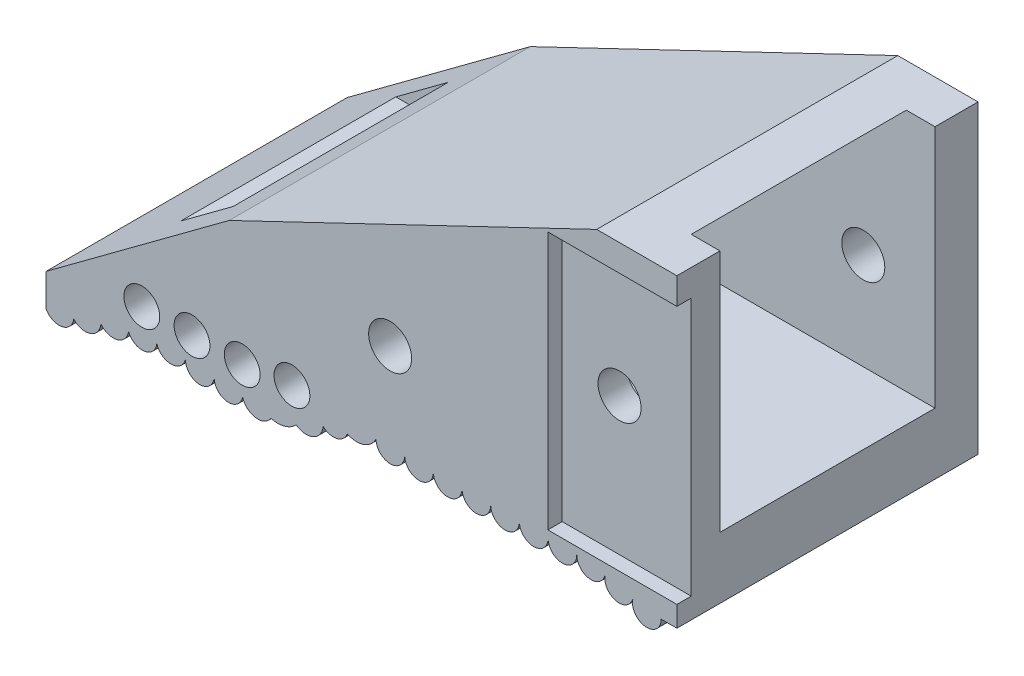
ISO-10303-21;
HEADER;
FILE_DESCRIPTION(('STEP AP214'),'2;1');
FILE_NAME('part.step','',(''),(''),'','','');
FILE_SCHEMA(('AUTOMOTIVE_DESIGN { 1 0 10303 214 1 1 1 1 }'));
ENDSEC;
DATA;
#1=APPLICATION_CONTEXT('core data for automotive mechanical design processes');
#2=APPLICATION_PROTOCOL_DEFINITION('international standard','automotive_design',2000,#1);
#3=PRODUCT_CONTEXT('',#1,'mechanical');
#4=PRODUCT('Part','Part','',(#3));
#5=PRODUCT_RELATED_PRODUCT_CATEGORY('part','',(#4));
#6=PRODUCT_DEFINITION_FORMATION('','',#4);
#7=PRODUCT_DEFINITION_CONTEXT('part definition',#1,'design');
#8=PRODUCT_DEFINITION('design','',#6,#7);
#9=PRODUCT_DEFINITION_SHAPE('','',#8);
#10=(LENGTH_UNIT() NAMED_UNIT(*) SI_UNIT(.MILLI.,.METRE.));
#11=(NAMED_UNIT(*) PLANE_ANGLE_UNIT() SI_UNIT($,.RADIAN.));
#12=(NAMED_UNIT(*) SI_UNIT($,.STERADIAN.) SOLID_ANGLE_UNIT());
#13=UNCERTAINTY_MEASURE_WITH_UNIT(LENGTH_MEASURE(1.E-05),#10,'distance_accuracy_value','');
#14=(GEOMETRIC_REPRESENTATION_CONTEXT(3) GLOBAL_UNCERTAINTY_ASSIGNED_CONTEXT((#13)) GLOBAL_UNIT_ASSIGNED_CONTEXT((#10,
#11,#12)) REPRESENTATION_CONTEXT('',''));
#15=CARTESIAN_POINT('',(0.,0.,0.));
#16=DIRECTION('',(0.,0.,1.));
#17=DIRECTION('',(1.,0.,0.));
#18=AXIS2_PLACEMENT_3D('',#15,#16,#17);
#19=CARTESIAN_POINT('',(-12.7783018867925,7.56792452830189,3.));
#20=DIRECTION('',(1.,0.,0.));
#21=DIRECTION('',(0.,1.,0.));
#22=AXIS2_PLACEMENT_3D('',#19,#20,#21);
#23=PLANE('',#22);
#24=DIRECTION('',(0.,0.,1.));
#25=VECTOR('',#24,1.);
#26=CARTESIAN_POINT('',(-12.7783018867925,-16.4320754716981,-9.));
#27=LINE('',#26,#25);
#28=CARTESIAN_POINT('',(-12.7783018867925,-16.4320754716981,0.));
#29=VERTEX_POINT('',#28);
#30=CARTESIAN_POINT('',(-12.7783018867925,-16.4320754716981,21.));
#31=VERTEX_POINT('',#30);
#32=EDGE_CURVE('E424',#29,#31,#27,.T.);
#33=ORIENTED_EDGE('',*,*,#32,.T.);
#34=DIRECTION('',(0.,-1.,0.));
#35=VECTOR('',#34,1.);
#36=CARTESIAN_POINT('',(-12.7783018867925,7.56792452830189,21.));
#37=LINE('',#36,#35);
#38=CARTESIAN_POINT('',(-12.7783018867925,-14.1707962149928,21.));
#39=VERTEX_POINT('',#38);
#40=EDGE_CURVE('E519',#39,#31,#37,.T.);
#41=ORIENTED_EDGE('',*,*,#40,.F.);
#42=DIRECTION('',(0.,0.,1.));
#43=VECTOR('',#42,1.);
#44=CARTESIAN_POINT('',(-12.7783018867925,-14.1707962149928,-9.));
#45=LINE('',#44,#43);
#46=CARTESIAN_POINT('',(-12.7783018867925,-14.1707962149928,0.));
#47=VERTEX_POINT('',#46);
#48=EDGE_CURVE('E427',#47,#39,#45,.T.);
#49=ORIENTED_EDGE('',*,*,#48,.F.);
#50=DIRECTION('',(0.,-1.,0.));
#51=VECTOR('',#50,1.);
#52=CARTESIAN_POINT('',(-12.7783018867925,7.56792452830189,0.));
#53=LINE('',#52,#51);
#54=EDGE_CURVE('E551',#47,#29,#53,.T.);
#55=ORIENTED_EDGE('',*,*,#54,.T.);
#56=EDGE_LOOP('',(#33,#41,#49,#55));
#57=FACE_BOUND('',#56,.T.);
#58=ADVANCED_FACE('F38',(#57),#23,.F.);
#59=CARTESIAN_POINT('',(31.2216981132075,7.56792452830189,3.));
#60=DIRECTION('',(-1.,0.,0.));
#61=DIRECTION('',(0.,-1.,0.));
#62=AXIS2_PLACEMENT_3D('',#59,#60,#61);
#63=PLANE('',#62);
#64=DIRECTION('',(0.,1.,0.));
#65=VECTOR('',#64,1.);
#66=CARTESIAN_POINT('',(31.2216981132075,5.71549631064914,20.));
#67=LINE('',#66,#65);
#68=CARTESIAN_POINT('',(31.2216981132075,-12.2845036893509,20.));
#69=VERTEX_POINT('',#68);
#70=CARTESIAN_POINT('',(31.2216981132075,5.71549631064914,20.));
#71=VERTEX_POINT('',#70);
#72=EDGE_CURVE('E284',#69,#71,#67,.T.);
#73=ORIENTED_EDGE('',*,*,#72,.F.);
#74=DIRECTION('',(0.,0.,1.));
#75=VECTOR('',#74,1.);
#76=CARTESIAN_POINT('',(31.2216981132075,-12.2845036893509,20.));
#77=LINE('',#76,#75);
#78=CARTESIAN_POINT('',(31.2216981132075,-12.2845036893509,21.));
#79=VERTEX_POINT('',#78);
#80=EDGE_CURVE('E700',#69,#79,#77,.T.);
#81=ORIENTED_EDGE('',*,*,#80,.T.);
#82=DIRECTION('',(0.,1.,0.));
#83=VECTOR('',#82,1.);
#84=CARTESIAN_POINT('',(31.2216981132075,7.56792452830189,21.));
#85=LINE('',#84,#83);
#86=CARTESIAN_POINT('',(31.2216981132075,-13.7245515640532,21.));
#87=VERTEX_POINT('',#86);
#88=EDGE_CURVE('E523',#87,#79,#85,.T.);
#89=ORIENTED_EDGE('',*,*,#88,.F.);
#90=DIRECTION('',(0.,0.,1.));
#91=VECTOR('',#90,1.);
#92=CARTESIAN_POINT('',(31.2216981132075,-13.7245515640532,-9.));
#93=LINE('',#92,#91);
#94=CARTESIAN_POINT('',(31.2216981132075,-13.7245515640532,0.));
#95=VERTEX_POINT('',#94);
#96=EDGE_CURVE('E435',#95,#87,#93,.T.);
#97=ORIENTED_EDGE('',*,*,#96,.F.);
#98=DIRECTION('',(0.,1.,0.));
#99=VECTOR('',#98,1.);
#100=CARTESIAN_POINT('',(31.2216981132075,7.56792452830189,0.));
#101=LINE('',#100,#99);
#102=CARTESIAN_POINT('',(31.2216981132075,7.56792452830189,0.));
#103=VERTEX_POINT('',#102);
#104=EDGE_CURVE('E559',#95,#103,#101,.T.);
#105=ORIENTED_EDGE('',*,*,#104,.T.);
#106=DIRECTION('',(0.,0.,-1.));
#107=VECTOR('',#106,1.);
#108=CARTESIAN_POINT('',(31.2216981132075,7.56792452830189,3.));
#109=LINE('',#108,#107);
#110=CARTESIAN_POINT('',(31.2216981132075,7.56792452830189,3.));
#111=VERTEX_POINT('',#110);
#112=EDGE_CURVE('E12',#111,#103,#109,.T.);
#113=ORIENTED_EDGE('',*,*,#112,.F.);
#114=DIRECTION('',(0.,1.,0.));
#115=VECTOR('',#114,1.);
#116=CARTESIAN_POINT('',(31.2216981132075,7.56792452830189,3.));
#117=LINE('',#116,#115);
#118=CARTESIAN_POINT('',(31.2216981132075,-9.43207547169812,3.));
#119=VERTEX_POINT('',#118);
#120=EDGE_CURVE('E552',#119,#111,#117,.T.);
#121=ORIENTED_EDGE('',*,*,#120,.F.);
#122=DIRECTION('',(0.,0.,-1.));
#123=VECTOR('',#122,1.);
#124=CARTESIAN_POINT('',(31.2216981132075,-9.43207547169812,18.));
#125=LINE('',#124,#123);
#126=CARTESIAN_POINT('',(31.2216981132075,-9.43207547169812,18.));
#127=VERTEX_POINT('',#126);
#128=EDGE_CURVE('E542',#127,#119,#125,.T.);
#129=ORIENTED_EDGE('',*,*,#128,.F.);
#130=DIRECTION('',(0.,1.,0.));
#131=VECTOR('',#130,1.);
#132=CARTESIAN_POINT('',(31.2216981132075,7.56792452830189,18.));
#133=LINE('',#132,#131);
#134=CARTESIAN_POINT('',(31.2216981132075,7.56792452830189,18.));
#135=VERTEX_POINT('',#134);
#136=EDGE_CURVE('E518',#127,#135,#133,.T.);
#137=ORIENTED_EDGE('',*,*,#136,.T.);
#138=DIRECTION('',(0.,0.,-1.));
#139=VECTOR('',#138,1.);
#140=CARTESIAN_POINT('',(31.2216981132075,7.56792452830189,21.));
#141=LINE('',#140,#139);
#142=CARTESIAN_POINT('',(31.2216981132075,7.56792452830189,21.));
#143=VERTEX_POINT('',#142);
#144=EDGE_CURVE('E529',#143,#135,#141,.T.);
#145=ORIENTED_EDGE('',*,*,#144,.F.);
#146=CARTESIAN_POINT('',(31.2216981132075,5.71549631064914,21.));
#147=VERTEX_POINT('',#146);
#148=EDGE_CURVE('E299',#147,#143,#85,.T.);
#149=ORIENTED_EDGE('',*,*,#148,.F.);
#150=DIRECTION('',(0.,0.,1.));
#151=VECTOR('',#150,1.);
#152=CARTESIAN_POINT('',(31.2216981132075,5.71549631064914,20.));
#153=LINE('',#152,#151);
#154=EDGE_CURVE('E53',#71,#147,#153,.T.);
#155=ORIENTED_EDGE('',*,*,#154,.F.);
#156=EDGE_LOOP('',(#73,#81,#89,#97,#105,#113,#121,#129,#137,#145,#149,#155));
#157=FACE_BOUND('',#156,.T.);
#158=ADVANCED_FACE('F297',(#157),#63,.F.);
#159=CARTESIAN_POINT('',(-12.7783018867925,7.56792452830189,3.));
#160=DIRECTION('',(0.,-1.,0.));
#161=DIRECTION('',(0.,0.,-1.));
#162=AXIS2_PLACEMENT_3D('',#159,#160,#161);
#163=PLANE('',#162);
#164=DIRECTION('',(0.,0.,1.));
#165=VECTOR('',#164,1.);
#166=CARTESIAN_POINT('',(25.6269388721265,7.56792452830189,-9.));
#167=LINE('',#166,#165);
#168=CARTESIAN_POINT('',(25.6269388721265,7.56792452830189,0.));
#169=VERTEX_POINT('',#168);
#170=CARTESIAN_POINT('',(25.6269388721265,7.56792452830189,21.));
#171=VERTEX_POINT('',#170);
#172=EDGE_CURVE('E432',#169,#171,#167,.T.);
#173=ORIENTED_EDGE('',*,*,#172,.T.);
#174=DIRECTION('',(-1.,0.,0.));
#175=VECTOR('',#174,1.);
#176=CARTESIAN_POINT('',(-12.7783018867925,7.56792452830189,21.));
#177=LINE('',#176,#175);
#178=EDGE_CURVE('E526',#143,#171,#177,.T.);
#179=ORIENTED_EDGE('',*,*,#178,.F.);
#180=ORIENTED_EDGE('',*,*,#144,.T.);
#181=DIRECTION('',(-1.,0.,0.));
#182=VECTOR('',#181,1.);
#183=CARTESIAN_POINT('',(-12.7783018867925,7.56792452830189,18.));
#184=LINE('',#183,#182);
#185=CARTESIAN_POINT('',(29.2216981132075,7.56792452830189,18.));
#186=VERTEX_POINT('',#185);
#187=EDGE_CURVE('E522',#135,#186,#184,.T.);
#188=ORIENTED_EDGE('',*,*,#187,.T.);
#189=DIRECTION('',(0.,0.,-1.));
#190=VECTOR('',#189,1.);
#191=CARTESIAN_POINT('',(29.2216981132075,7.56792452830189,18.));
#192=LINE('',#191,#190);
#193=CARTESIAN_POINT('',(29.2216981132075,7.56792452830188,3.));
#194=VERTEX_POINT('',#193);
#195=EDGE_CURVE('E548',#186,#194,#192,.T.);
#196=ORIENTED_EDGE('',*,*,#195,.T.);
#197=DIRECTION('',(-1.,0.,0.));
#198=VECTOR('',#197,1.);
#199=CARTESIAN_POINT('',(-12.7783018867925,7.56792452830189,3.));
#200=LINE('',#199,#198);
#201=EDGE_CURVE('E46',#111,#194,#200,.T.);
#202=ORIENTED_EDGE('',*,*,#201,.F.);
#203=ORIENTED_EDGE('',*,*,#112,.T.);
#204=DIRECTION('',(-1.,0.,0.));
#205=VECTOR('',#204,1.);
#206=CARTESIAN_POINT('',(-12.7783018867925,7.56792452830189,0.));
#207=LINE('',#206,#205);
#208=EDGE_CURVE('E554',#103,#169,#207,.T.);
#209=ORIENTED_EDGE('',*,*,#208,.T.);
#210=EDGE_LOOP('',(#173,#179,#180,#188,#196,#202,#203,#209));
#211=FACE_BOUND('',#210,.T.);
#212=ADVANCED_FACE('F564',(#211),#163,.F.);
#213=CARTESIAN_POINT('',(0.,0.,3.));
#214=DIRECTION('',(0.,0.,1.));
#215=DIRECTION('',(1.,0.,0.));
#216=AXIS2_PLACEMENT_3D('',#213,#214,#215);
#217=PLANE('',#216);
#218=CARTESIAN_POINT('',(11.2216981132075,-6.68207547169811,3.));
#219=DIRECTION('',(0.,0.,1.));
#220=DIRECTION('',(1.,0.,0.));
#221=AXIS2_PLACEMENT_3D('',#218,#219,#220);
#222=CIRCLE('',#221,1.5);
#223=CARTESIAN_POINT('',(12.7216981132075,-6.68207547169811,3.));
#224=VERTEX_POINT('',#223);
#225=EDGE_CURVE('E315',#224,#224,#222,.T.);
#226=ORIENTED_EDGE('',*,*,#225,.F.);
#227=EDGE_LOOP('',(#226));
#228=FACE_BOUND('',#227,.T.);
#229=CARTESIAN_POINT('',(26.2216981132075,-2.68207547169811,3.));
#230=DIRECTION('',(0.,0.,1.));
#231=DIRECTION('',(1.,0.,0.));
#232=AXIS2_PLACEMENT_3D('',#229,#230,#231);
#233=CIRCLE('',#232,1.5);
#234=CARTESIAN_POINT('',(27.7216981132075,-2.68207547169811,3.));
#235=VERTEX_POINT('',#234);
#236=EDGE_CURVE('E324',#235,#235,#233,.T.);
#237=ORIENTED_EDGE('',*,*,#236,.F.);
#238=EDGE_LOOP('',(#237));
#239=FACE_BOUND('',#238,.T.);
#240=DIRECTION('',(0.91281825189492,0.408366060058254,0.));
#241=VECTOR('',#240,1.);
#242=CARTESIAN_POINT('',(29.2216981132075,7.56792452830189,3.));
#243=LINE('',#242,#241);
#244=CARTESIAN_POINT('',(-2.72875212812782,-6.72569794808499,3.));
#245=VERTEX_POINT('',#244);
#246=EDGE_CURVE('E535',#245,#194,#243,.T.);
#247=ORIENTED_EDGE('',*,*,#246,.F.);
#248=DIRECTION('',(-0.803519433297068,-0.595278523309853,0.));
#249=VECTOR('',#248,1.);
#250=CARTESIAN_POINT('',(2.25007035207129,-3.03719214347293,3.));
#251=LINE('',#250,#249);
#252=CARTESIAN_POINT('',(-6.38187726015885,-9.43207547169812,3.));
#253=VERTEX_POINT('',#252);
#254=EDGE_CURVE('E491',#245,#253,#251,.T.);
#255=ORIENTED_EDGE('',*,*,#254,.T.);
#256=DIRECTION('',(-1.,0.,0.));
#257=VECTOR('',#256,1.);
#258=CARTESIAN_POINT('',(-8.77830188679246,-9.43207547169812,3.));
#259=LINE('',#258,#257);
#260=EDGE_CURVE('E539',#119,#253,#259,.T.);
#261=ORIENTED_EDGE('',*,*,#260,.F.);
#262=ORIENTED_EDGE('',*,*,#120,.T.);
#263=ORIENTED_EDGE('',*,*,#201,.T.);
#264=EDGE_LOOP('',(#247,#255,#261,#262,#263));
#265=FACE_BOUND('',#264,.T.);
#266=ADVANCED_FACE('F763',(#228,#239,#265),#217,.T.);
#267=CARTESIAN_POINT('',(0.,0.,0.));
#268=DIRECTION('',(0.,0.,1.));
#269=DIRECTION('',(1.,0.,0.));
#270=AXIS2_PLACEMENT_3D('',#267,#268,#269);
#271=PLANE('',#270);
#272=CARTESIAN_POINT('',(-6.09529267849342,-12.9533373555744,0.));
#273=DIRECTION('',(0.,0.,1.));
#274=DIRECTION('',(1.,0.,0.));
#275=AXIS2_PLACEMENT_3D('',#272,#273,#274);
#276=CIRCLE('',#275,1.25);
#277=CARTESIAN_POINT('',(-4.84529267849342,-12.9533373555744,0.));
#278=VERTEX_POINT('',#277);
#279=EDGE_CURVE('E713',#278,#278,#276,.T.);
#280=ORIENTED_EDGE('',*,*,#279,.T.);
#281=EDGE_LOOP('',(#280));
#282=FACE_BOUND('',#281,.T.);
#283=CARTESIAN_POINT('',(-2.59529267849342,-12.9533373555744,0.));
#284=DIRECTION('',(0.,0.,1.));
#285=DIRECTION('',(1.,0.,0.));
#286=AXIS2_PLACEMENT_3D('',#283,#284,#285);
#287=CIRCLE('',#286,1.25);
#288=CARTESIAN_POINT('',(-1.34529267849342,-12.9533373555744,0.));
#289=VERTEX_POINT('',#288);
#290=EDGE_CURVE('E715',#289,#289,#287,.T.);
#291=ORIENTED_EDGE('',*,*,#290,.T.);
#292=EDGE_LOOP('',(#291));
#293=FACE_BOUND('',#292,.T.);
#294=CARTESIAN_POINT('',(0.904707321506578,-12.9533373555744,0.));
#295=DIRECTION('',(0.,0.,1.));
#296=DIRECTION('',(1.,0.,0.));
#297=AXIS2_PLACEMENT_3D('',#294,#295,#296);
#298=CIRCLE('',#297,1.25);
#299=CARTESIAN_POINT('',(2.15470732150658,-12.9533373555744,0.));
#300=VERTEX_POINT('',#299);
#301=EDGE_CURVE('E721',#300,#300,#298,.T.);
#302=ORIENTED_EDGE('',*,*,#301,.T.);
#303=EDGE_LOOP('',(#302));
#304=FACE_BOUND('',#303,.T.);
#305=CARTESIAN_POINT('',(4.37363290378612,-12.487982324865,0.));
#306=DIRECTION('',(0.,0.,1.));
#307=DIRECTION('',(1.,0.,0.));
#308=AXIS2_PLACEMENT_3D('',#305,#306,#307);
#309=CIRCLE('',#308,1.25);
#310=CARTESIAN_POINT('',(5.62363290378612,-12.487982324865,0.));
#311=VERTEX_POINT('',#310);
#312=EDGE_CURVE('E724',#311,#311,#309,.T.);
#313=ORIENTED_EDGE('',*,*,#312,.T.);
#314=EDGE_LOOP('',(#313));
#315=FACE_BOUND('',#314,.T.);
#316=CARTESIAN_POINT('',(11.2216981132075,-6.68207547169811,0.));
#317=DIRECTION('',(0.,0.,1.));
#318=DIRECTION('',(1.,0.,0.));
#319=AXIS2_PLACEMENT_3D('',#316,#317,#318);
#320=CIRCLE('',#319,1.5);
#321=CARTESIAN_POINT('',(12.7216981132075,-6.68207547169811,0.));
#322=VERTEX_POINT('',#321);
#323=EDGE_CURVE('E312',#322,#322,#320,.T.);
#324=ORIENTED_EDGE('',*,*,#323,.T.);
#325=EDGE_LOOP('',(#324));
#326=FACE_BOUND('',#325,.T.);
#327=CARTESIAN_POINT('',(26.2216981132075,-2.68207547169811,0.));
#328=DIRECTION('',(0.,0.,1.));
#329=DIRECTION('',(1.,0.,0.));
#330=AXIS2_PLACEMENT_3D('',#327,#328,#329);
#331=CIRCLE('',#330,1.5);
#332=CARTESIAN_POINT('',(27.7216981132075,-2.68207547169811,0.));
#333=VERTEX_POINT('',#332);
#334=EDGE_CURVE('E321',#333,#333,#331,.T.);
#335=ORIENTED_EDGE('',*,*,#334,.T.);
#336=EDGE_LOOP('',(#335));
#337=FACE_BOUND('',#336,.T.);
#338=DIRECTION('',(-0.803519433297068,-0.595278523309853,0.));
#339=VECTOR('',#338,1.);
#340=CARTESIAN_POINT('',(2.25007035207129,-3.03719214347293,0.));
#341=LINE('',#340,#339);
#342=CARTESIAN_POINT('',(0.,-4.70413198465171,0.));
#343=VERTEX_POINT('',#342);
#344=EDGE_CURVE('E494',#343,#47,#341,.T.);
#345=ORIENTED_EDGE('',*,*,#344,.F.);
#346=DIRECTION('',(-0.901919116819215,-0.431904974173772,0.));
#347=VECTOR('',#346,1.);
#348=CARTESIAN_POINT('',(1.83246334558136,-3.82661423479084,0.));
#349=LINE('',#348,#347);
#350=EDGE_CURVE('E484',#169,#343,#349,.T.);
#351=ORIENTED_EDGE('',*,*,#350,.F.);
#352=ORIENTED_EDGE('',*,*,#208,.F.);
#353=ORIENTED_EDGE('',*,*,#104,.F.);
#354=DIRECTION('',(1.,0.,0.));
#355=VECTOR('',#354,1.);
#356=CARTESIAN_POINT('',(0.,-13.7245515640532,0.));
#357=LINE('',#356,#355);
#358=CARTESIAN_POINT('',(30.1248704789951,-13.7245515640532,0.));
#359=VERTEX_POINT('',#358);
#360=EDGE_CURVE('E482',#359,#95,#357,.T.);
#361=ORIENTED_EDGE('',*,*,#360,.F.);
#362=CARTESIAN_POINT('',(29.124870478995,-13.7245515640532,0.));
#363=DIRECTION('',(0.,0.,1.));
#364=DIRECTION('',(1.,0.,0.));
#365=AXIS2_PLACEMENT_3D('',#362,#363,#364);
#366=CIRCLE('',#365,1.00000000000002);
#367=CARTESIAN_POINT('',(28.1579997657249,-13.4692849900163,0.));
#368=VERTEX_POINT('',#367);
#369=EDGE_CURVE('E480',#368,#359,#366,.T.);
#370=ORIENTED_EDGE('',*,*,#369,.F.);
#371=CARTESIAN_POINT('',(27.1911290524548,-13.2140184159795,0.));
#372=DIRECTION('',(0.,0.,1.));
#373=DIRECTION('',(1.,0.,0.));
#374=AXIS2_PLACEMENT_3D('',#371,#372,#373);
#375=CIRCLE('',#374,0.99999999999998);
#376=CARTESIAN_POINT('',(26.2143065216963,-12.9999676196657,0.));
#377=VERTEX_POINT('',#376);
#378=EDGE_CURVE('E478',#377,#368,#375,.T.);
#379=ORIENTED_EDGE('',*,*,#378,.F.);
#380=CARTESIAN_POINT('',(25.2374839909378,-12.7859168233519,0.));
#381=DIRECTION('',(0.,0.,1.));
#382=DIRECTION('',(1.,0.,0.));
#383=AXIS2_PLACEMENT_3D('',#380,#381,#382);
#384=CIRCLE('',#383,1.00000000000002);
#385=CARTESIAN_POINT('',(24.2374839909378,-12.7859168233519,0.));
#386=VERTEX_POINT('',#385);
#387=EDGE_CURVE('E476',#386,#377,#384,.T.);
#388=ORIENTED_EDGE('',*,*,#387,.F.);
#389=CARTESIAN_POINT('',(23.2374839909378,-12.7859168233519,0.));
#390=DIRECTION('',(0.,0.,1.));
#391=DIRECTION('',(1.,0.,0.));
#392=AXIS2_PLACEMENT_3D('',#389,#390,#391);
#393=CIRCLE('',#392,0.999999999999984);
#394=CARTESIAN_POINT('',(22.2374839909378,-12.7859168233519,0.));
#395=VERTEX_POINT('',#394);
#396=EDGE_CURVE('E474',#395,#386,#393,.T.);
#397=ORIENTED_EDGE('',*,*,#396,.F.);
#398=CARTESIAN_POINT('',(21.2374839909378,-12.7859168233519,0.));
#399=DIRECTION('',(0.,0.,1.));
#400=DIRECTION('',(1.,0.,0.));
#401=AXIS2_PLACEMENT_3D('',#398,#399,#400);
#402=CIRCLE('',#401,1.00000000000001);
#403=CARTESIAN_POINT('',(20.2374839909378,-12.7859168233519,0.));
#404=VERTEX_POINT('',#403);
#405=EDGE_CURVE('E472',#404,#395,#402,.T.);
#406=ORIENTED_EDGE('',*,*,#405,.F.);
#407=CARTESIAN_POINT('',(19.2374839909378,-12.7859168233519,0.));
#408=DIRECTION('',(0.,0.,1.));
#409=DIRECTION('',(1.,0.,0.));
#410=AXIS2_PLACEMENT_3D('',#407,#408,#409);
#411=CIRCLE('',#410,0.999999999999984);
#412=CARTESIAN_POINT('',(18.2374839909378,-12.7859168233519,0.));
#413=VERTEX_POINT('',#412);
#414=EDGE_CURVE('E470',#413,#404,#411,.T.);
#415=ORIENTED_EDGE('',*,*,#414,.F.);
#416=CARTESIAN_POINT('',(17.2374839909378,-12.7859168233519,0.));
#417=DIRECTION('',(0.,0.,1.));
#418=DIRECTION('',(1.,0.,0.));
#419=AXIS2_PLACEMENT_3D('',#416,#417,#418);
#420=CIRCLE('',#419,1.00000000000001);
#421=CARTESIAN_POINT('',(16.2374839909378,-12.7859168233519,0.));
#422=VERTEX_POINT('',#421);
#423=EDGE_CURVE('E468',#422,#413,#420,.T.);
#424=ORIENTED_EDGE('',*,*,#423,.F.);
#425=CARTESIAN_POINT('',(15.2374839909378,-12.7859168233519,0.));
#426=DIRECTION('',(0.,0.,1.));
#427=DIRECTION('',(1.,0.,0.));
#428=AXIS2_PLACEMENT_3D('',#425,#426,#427);
#429=CIRCLE('',#428,0.999999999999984);
#430=CARTESIAN_POINT('',(14.2374839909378,-12.7859168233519,0.));
#431=VERTEX_POINT('',#430);
#432=EDGE_CURVE('E466',#431,#422,#429,.T.);
#433=ORIENTED_EDGE('',*,*,#432,.F.);
#434=CARTESIAN_POINT('',(13.2374839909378,-12.7859168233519,0.));
#435=DIRECTION('',(0.,0.,1.));
#436=DIRECTION('',(1.,0.,0.));
#437=AXIS2_PLACEMENT_3D('',#434,#435,#436);
#438=CIRCLE('',#437,1.00000000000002);
#439=CARTESIAN_POINT('',(12.2374839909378,-12.7859168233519,0.));
#440=VERTEX_POINT('',#439);
#441=EDGE_CURVE('E464',#440,#431,#438,.T.);
#442=ORIENTED_EDGE('',*,*,#441,.F.);
#443=CARTESIAN_POINT('',(11.2374839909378,-12.7859168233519,0.));
#444=DIRECTION('',(0.,0.,1.));
#445=DIRECTION('',(1.,0.,0.));
#446=AXIS2_PLACEMENT_3D('',#443,#444,#445);
#447=CIRCLE('',#446,0.999999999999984);
#448=CARTESIAN_POINT('',(10.2374839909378,-12.7859168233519,0.));
#449=VERTEX_POINT('',#448);
#450=EDGE_CURVE('E462',#449,#440,#447,.T.);
#451=ORIENTED_EDGE('',*,*,#450,.F.);
#452=CARTESIAN_POINT('',(8.89247256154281,-12.131448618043,0.));
#453=DIRECTION('',(0.,0.,1.));
#454=DIRECTION('',(1.,0.,0.));
#455=AXIS2_PLACEMENT_3D('',#452,#453,#454);
#456=CIRCLE('',#455,1.49578888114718);
#457=CARTESIAN_POINT('',(8.23800435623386,-13.476460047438,0.));
#458=VERTEX_POINT('',#457);
#459=EDGE_CURVE('E405',#458,#449,#456,.T.);
#460=ORIENTED_EDGE('',*,*,#459,.F.);
#461=CARTESIAN_POINT('',(7.26475376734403,-13.1150603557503,0.));
#462=DIRECTION('',(0.,0.,1.));
#463=DIRECTION('',(1.,0.,0.));
#464=AXIS2_PLACEMENT_3D('',#461,#462,#463);
#465=CIRCLE('',#464,1.03818420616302);
#466=CARTESIAN_POINT('',(6.55334804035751,-13.8711875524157,0.));
#467=VERTEX_POINT('',#466);
#468=EDGE_CURVE('E516',#467,#458,#465,.T.);
#469=ORIENTED_EDGE('',*,*,#468,.F.);
#470=CARTESIAN_POINT('',(5.3699333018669,-13.7551036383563,0.));
#471=DIRECTION('',(0.,0.,1.));
#472=DIRECTION('',(1.,0.,0.));
#473=AXIS2_PLACEMENT_3D('',#470,#471,#472);
#474=CIRCLE('',#473,1.18909457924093);
#475=CARTESIAN_POINT('',(4.67424723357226,-14.7194515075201,0.));
#476=VERTEX_POINT('',#475);
#477=EDGE_CURVE('E514',#476,#467,#474,.T.);
#478=ORIENTED_EDGE('',*,*,#477,.F.);
#479=CARTESIAN_POINT('',(3.38888148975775,-13.4804516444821,0.));
#480=DIRECTION('',(0.,0.,1.));
#481=DIRECTION('',(1.,0.,0.));
#482=AXIS2_PLACEMENT_3D('',#479,#480,#481);
#483=CIRCLE('',#482,1.78529710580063);
#484=CARTESIAN_POINT('',(2.91014395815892,-15.2003633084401,0.));
#485=VERTEX_POINT('',#484);
#486=EDGE_CURVE('E512',#485,#476,#483,.T.);
#487=ORIENTED_EDGE('',*,*,#486,.F.);
#488=CARTESIAN_POINT('',(1.98983234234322,-14.6151646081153,0.));
#489=DIRECTION('',(0.,0.,1.));
#490=DIRECTION('',(1.,0.,0.));
#491=AXIS2_PLACEMENT_3D('',#488,#489,#490);
#492=CIRCLE('',#491,1.09061037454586);
#493=CARTESIAN_POINT('',(0.934546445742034,-14.8904874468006,0.));
#494=VERTEX_POINT('',#493);
#495=EDGE_CURVE('E510',#494,#485,#492,.T.);
#496=ORIENTED_EDGE('',*,*,#495,.F.);
#497=CARTESIAN_POINT('',(-0.050812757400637,-14.719996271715,0.));
#498=DIRECTION('',(0.,0.,1.));
#499=DIRECTION('',(1.,0.,0.));
#500=AXIS2_PLACEMENT_3D('',#497,#498,#499);
#501=CIRCLE('',#500,1.);
#502=CARTESIAN_POINT('',(-1.05013096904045,-14.6830759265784,0.));
#503=VERTEX_POINT('',#502);
#504=EDGE_CURVE('E508',#503,#494,#501,.T.);
#505=ORIENTED_EDGE('',*,*,#504,.F.);
#506=CARTESIAN_POINT('',(-2.04941287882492,-14.6461569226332,0.));
#507=DIRECTION('',(0.,0.,1.));
#508=DIRECTION('',(1.,0.,0.));
#509=AXIS2_PLACEMENT_3D('',#506,#507,#508);
#510=CIRCLE('',#509,0.999963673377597);
#511=CARTESIAN_POINT('',(-3.04884305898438,-14.6134971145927,0.));
#512=VERTEX_POINT('',#511);
#513=EDGE_CURVE('E506',#512,#503,#510,.T.);
#514=ORIENTED_EDGE('',*,*,#513,.F.);
#515=CARTESIAN_POINT('',(-4.05600076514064,-14.3756676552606,0.));
#516=DIRECTION('',(0.,0.,1.));
#517=DIRECTION('',(1.,0.,0.));
#518=AXIS2_PLACEMENT_3D('',#515,#516,#517);
#519=CIRCLE('',#518,1.03485723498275);
#520=CARTESIAN_POINT('',(-5.04913448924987,-14.6665540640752,0.));
#521=VERTEX_POINT('',#520);
#522=EDGE_CURVE('E504',#521,#512,#519,.T.);
#523=ORIENTED_EDGE('',*,*,#522,.F.);
#524=CARTESIAN_POINT('',(-6.06388338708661,-14.553216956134,0.));
#525=DIRECTION('',(0.,0.,1.));
#526=DIRECTION('',(1.,0.,0.));
#527=AXIS2_PLACEMENT_3D('',#524,#525,#526);
#528=CIRCLE('',#527,1.02105858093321);
#529=CARTESIAN_POINT('',(-7.01772115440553,-14.9175713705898,0.));
#530=VERTEX_POINT('',#529);
#531=EDGE_CURVE('E502',#530,#521,#528,.T.);
#532=ORIENTED_EDGE('',*,*,#531,.F.);
#533=CARTESIAN_POINT('',(-8.09375318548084,-14.7614181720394,0.));
#534=DIRECTION('',(0.,0.,1.));
#535=DIRECTION('',(1.,0.,0.));
#536=AXIS2_PLACEMENT_3D('',#533,#534,#535);
#537=CIRCLE('',#536,1.08730343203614);
#538=CARTESIAN_POINT('',(-8.95158467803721,-15.4295153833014,0.));
#539=VERTEX_POINT('',#538);
#540=EDGE_CURVE('E500',#539,#530,#537,.T.);
#541=ORIENTED_EDGE('',*,*,#540,.F.);
#542=CARTESIAN_POINT('',(-10.0391082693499,-15.3435044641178,0.));
#543=DIRECTION('',(0.,0.,1.));
#544=DIRECTION('',(1.,0.,0.));
#545=AXIS2_PLACEMENT_3D('',#542,#543,#544);
#546=CIRCLE('',#545,1.09091953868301);
#547=CARTESIAN_POINT('',(-10.8412542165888,-16.0828740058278,0.));
#548=VERTEX_POINT('',#547);
#549=EDGE_CURVE('E498',#548,#539,#546,.T.);
#550=ORIENTED_EDGE('',*,*,#549,.F.);
#551=CARTESIAN_POINT('',(-11.8679082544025,-15.9350219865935,0.));
#552=DIRECTION('',(0.,0.,1.));
#553=DIRECTION('',(1.,0.,0.));
#554=AXIS2_PLACEMENT_3D('',#551,#552,#553);
#555=CIRCLE('',#554,1.03724574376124);
#556=EDGE_CURVE('E496',#29,#548,#555,.T.);
#557=ORIENTED_EDGE('',*,*,#556,.F.);
#558=ORIENTED_EDGE('',*,*,#54,.F.);
#559=EDGE_LOOP('',(#345,#351,#352,#353,#361,#370,#379,#388,#397,#406,#415,#424,#433,#442,#451,
#460,#469,#478,#487,#496,#505,#514,#523,#532,#541,#550,#557,#558));
#560=FACE_BOUND('',#559,.T.);
#561=ADVANCED_FACE('F572',(#282,#293,#304,#315,#326,#337,#560),#271,.F.);
#562=CARTESIAN_POINT('',(29.2216981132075,7.56792452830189,18.));
#563=DIRECTION('',(-0.408366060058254,0.91281825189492,0.));
#564=DIRECTION('',(-0.91281825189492,-0.408366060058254,0.));
#565=AXIS2_PLACEMENT_3D('',#562,#563,#564);
#566=PLANE('',#565);
#567=DIRECTION('',(0.,0.,1.));
#568=VECTOR('',#567,1.);
#569=CARTESIAN_POINT('',(-2.72875212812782,-6.72569794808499,18.));
#570=LINE('',#569,#568);
#571=CARTESIAN_POINT('',(-2.7287521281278,-6.72569794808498,18.));
#572=VERTEX_POINT('',#571);
#573=EDGE_CURVE('E61',#245,#572,#570,.T.);
#574=ORIENTED_EDGE('',*,*,#573,.F.);
#575=ORIENTED_EDGE('',*,*,#246,.T.);
#576=ORIENTED_EDGE('',*,*,#195,.F.);
#577=DIRECTION('',(0.91281825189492,0.408366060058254,0.));
#578=VECTOR('',#577,1.);
#579=CARTESIAN_POINT('',(29.2216981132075,7.56792452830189,18.));
#580=LINE('',#579,#578);
#581=EDGE_CURVE('E536',#572,#186,#580,.T.);
#582=ORIENTED_EDGE('',*,*,#581,.F.);
#583=EDGE_LOOP('',(#574,#575,#576,#582));
#584=FACE_BOUND('',#583,.T.);
#585=ADVANCED_FACE('F762',(#584),#566,.F.);
#586=CARTESIAN_POINT('',(-8.77830188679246,-9.43207547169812,18.));
#587=DIRECTION('',(0.,-1.,0.));
#588=DIRECTION('',(0.,0.,-1.));
#589=AXIS2_PLACEMENT_3D('',#586,#587,#588);
#590=PLANE('',#589);
#591=DIRECTION('',(0.,0.,-1.));
#592=VECTOR('',#591,1.);
#593=CARTESIAN_POINT('',(-6.38187726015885,-9.43207547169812,18.));
#594=LINE('',#593,#592);
#595=CARTESIAN_POINT('',(-6.38187726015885,-9.43207547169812,18.));
#596=VERTEX_POINT('',#595);
#597=EDGE_CURVE('E488',#596,#253,#594,.T.);
#598=ORIENTED_EDGE('',*,*,#597,.F.);
#599=DIRECTION('',(-1.,0.,0.));
#600=VECTOR('',#599,1.);
#601=CARTESIAN_POINT('',(-8.77830188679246,-9.43207547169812,18.));
#602=LINE('',#601,#600);
#603=EDGE_CURVE('E538',#127,#596,#602,.T.);
#604=ORIENTED_EDGE('',*,*,#603,.F.);
#605=ORIENTED_EDGE('',*,*,#128,.T.);
#606=ORIENTED_EDGE('',*,*,#260,.T.);
#607=EDGE_LOOP('',(#598,#604,#605,#606));
#608=FACE_BOUND('',#607,.T.);
#609=ADVANCED_FACE('F799',(#608),#590,.F.);
#610=CARTESIAN_POINT('',(0.,0.,18.));
#611=DIRECTION('',(0.,0.,1.));
#612=DIRECTION('',(1.,0.,0.));
#613=AXIS2_PLACEMENT_3D('',#610,#611,#612);
#614=PLANE('',#613);
#615=CARTESIAN_POINT('',(11.2216981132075,-6.68207547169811,18.));
#616=DIRECTION('',(0.,0.,1.));
#617=DIRECTION('',(1.,0.,0.));
#618=AXIS2_PLACEMENT_3D('',#615,#616,#617);
#619=CIRCLE('',#618,1.5);
#620=CARTESIAN_POINT('',(12.7216981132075,-6.68207547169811,18.));
#621=VERTEX_POINT('',#620);
#622=EDGE_CURVE('E309',#621,#621,#619,.T.);
#623=ORIENTED_EDGE('',*,*,#622,.T.);
#624=EDGE_LOOP('',(#623));
#625=FACE_BOUND('',#624,.T.);
#626=CARTESIAN_POINT('',(26.2216981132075,-2.68207547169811,18.));
#627=DIRECTION('',(0.,0.,1.));
#628=DIRECTION('',(1.,0.,0.));
#629=AXIS2_PLACEMENT_3D('',#626,#627,#628);
#630=CIRCLE('',#629,1.5);
#631=CARTESIAN_POINT('',(27.7216981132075,-2.68207547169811,18.));
#632=VERTEX_POINT('',#631);
#633=EDGE_CURVE('E318',#632,#632,#630,.T.);
#634=ORIENTED_EDGE('',*,*,#633,.T.);
#635=EDGE_LOOP('',(#634));
#636=FACE_BOUND('',#635,.T.);
#637=DIRECTION('',(-0.803519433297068,-0.595278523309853,0.));
#638=VECTOR('',#637,1.);
#639=CARTESIAN_POINT('',(2.25007035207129,-3.03719214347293,18.));
#640=LINE('',#639,#638);
#641=EDGE_CURVE('E486',#572,#596,#640,.T.);
#642=ORIENTED_EDGE('',*,*,#641,.F.);
#643=ORIENTED_EDGE('',*,*,#581,.T.);
#644=ORIENTED_EDGE('',*,*,#187,.F.);
#645=ORIENTED_EDGE('',*,*,#136,.F.);
#646=ORIENTED_EDGE('',*,*,#603,.T.);
#647=EDGE_LOOP('',(#642,#643,#644,#645,#646));
#648=FACE_BOUND('',#647,.T.);
#649=ADVANCED_FACE('F745',(#625,#636,#648),#614,.F.);
#650=CARTESIAN_POINT('',(0.,0.,21.));
#651=DIRECTION('',(0.,0.,1.));
#652=DIRECTION('',(1.,0.,0.));
#653=AXIS2_PLACEMENT_3D('',#650,#651,#652);
#654=PLANE('',#653);
#655=CARTESIAN_POINT('',(-6.09529267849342,-12.9533373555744,21.));
#656=DIRECTION('',(0.,0.,1.));
#657=DIRECTION('',(1.,0.,0.));
#658=AXIS2_PLACEMENT_3D('',#655,#656,#657);
#659=CIRCLE('',#658,1.25);
#660=CARTESIAN_POINT('',(-4.84529267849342,-12.9533373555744,21.));
#661=VERTEX_POINT('',#660);
#662=EDGE_CURVE('E727',#661,#661,#659,.T.);
#663=ORIENTED_EDGE('',*,*,#662,.F.);
#664=EDGE_LOOP('',(#663));
#665=FACE_BOUND('',#664,.T.);
#666=CARTESIAN_POINT('',(-2.59529267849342,-12.9533373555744,21.));
#667=DIRECTION('',(0.,0.,1.));
#668=DIRECTION('',(1.,0.,0.));
#669=AXIS2_PLACEMENT_3D('',#666,#667,#668);
#670=CIRCLE('',#669,1.25);
#671=CARTESIAN_POINT('',(-1.34529267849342,-12.9533373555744,21.));
#672=VERTEX_POINT('',#671);
#673=EDGE_CURVE('E734',#672,#672,#670,.T.);
#674=ORIENTED_EDGE('',*,*,#673,.F.);
#675=EDGE_LOOP('',(#674));
#676=FACE_BOUND('',#675,.T.);
#677=CARTESIAN_POINT('',(0.904707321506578,-12.9533373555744,21.));
#678=DIRECTION('',(0.,0.,1.));
#679=DIRECTION('',(1.,0.,0.));
#680=AXIS2_PLACEMENT_3D('',#677,#678,#679);
#681=CIRCLE('',#680,1.25);
#682=CARTESIAN_POINT('',(2.15470732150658,-12.9533373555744,21.));
#683=VERTEX_POINT('',#682);
#684=EDGE_CURVE('E731',#683,#683,#681,.T.);
#685=ORIENTED_EDGE('',*,*,#684,.F.);
#686=EDGE_LOOP('',(#685));
#687=FACE_BOUND('',#686,.T.);
#688=CARTESIAN_POINT('',(4.37363290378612,-12.487982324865,21.));
#689=DIRECTION('',(0.,0.,1.));
#690=DIRECTION('',(1.,0.,0.));
#691=AXIS2_PLACEMENT_3D('',#688,#689,#690);
#692=CIRCLE('',#691,1.25);
#693=CARTESIAN_POINT('',(5.62363290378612,-12.487982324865,21.));
#694=VERTEX_POINT('',#693);
#695=EDGE_CURVE('E728',#694,#694,#692,.T.);
#696=ORIENTED_EDGE('',*,*,#695,.F.);
#697=EDGE_LOOP('',(#696));
#698=FACE_BOUND('',#697,.T.);
#699=DIRECTION('',(1.,0.,0.));
#700=VECTOR('',#699,1.);
#701=CARTESIAN_POINT('',(31.2216981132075,-12.2845036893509,21.));
#702=LINE('',#701,#700);
#703=CARTESIAN_POINT('',(22.2216981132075,-12.2845036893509,21.));
#704=VERTEX_POINT('',#703);
#705=EDGE_CURVE('E294',#704,#79,#702,.T.);
#706=ORIENTED_EDGE('',*,*,#705,.F.);
#707=DIRECTION('',(0.,-1.,0.));
#708=VECTOR('',#707,1.);
#709=CARTESIAN_POINT('',(22.2216981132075,5.71549631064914,21.));
#710=LINE('',#709,#708);
#711=CARTESIAN_POINT('',(22.2216981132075,5.71549631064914,21.));
#712=VERTEX_POINT('',#711);
#713=EDGE_CURVE('E703',#712,#704,#710,.T.);
#714=ORIENTED_EDGE('',*,*,#713,.F.);
#715=DIRECTION('',(-1.,0.,0.));
#716=VECTOR('',#715,1.);
#717=CARTESIAN_POINT('',(31.2216981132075,5.71549631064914,21.));
#718=LINE('',#717,#716);
#719=EDGE_CURVE('E706',#147,#712,#718,.T.);
#720=ORIENTED_EDGE('',*,*,#719,.F.);
#721=ORIENTED_EDGE('',*,*,#148,.T.);
#722=ORIENTED_EDGE('',*,*,#178,.T.);
#723=DIRECTION('',(-0.901919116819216,-0.431904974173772,0.));
#724=VECTOR('',#723,1.);
#725=CARTESIAN_POINT('',(25.6269388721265,7.56792452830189,21.));
#726=LINE('',#725,#724);
#727=CARTESIAN_POINT('',(0.,-4.70413198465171,21.));
#728=VERTEX_POINT('',#727);
#729=EDGE_CURVE('E366',#171,#728,#726,.T.);
#730=ORIENTED_EDGE('',*,*,#729,.T.);
#731=DIRECTION('',(-0.803519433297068,-0.595278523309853,0.));
#732=VECTOR('',#731,1.);
#733=CARTESIAN_POINT('',(0.,-4.70413198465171,21.));
#734=LINE('',#733,#732);
#735=EDGE_CURVE('E369',#728,#39,#734,.T.);
#736=ORIENTED_EDGE('',*,*,#735,.T.);
#737=ORIENTED_EDGE('',*,*,#40,.T.);
#738=CARTESIAN_POINT('',(-11.8679082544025,-15.9350219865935,21.));
#739=DIRECTION('',(0.,0.,1.));
#740=DIRECTION('',(1.,0.,0.));
#741=AXIS2_PLACEMENT_3D('',#738,#739,#740);
#742=CIRCLE('',#741,1.03724574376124);
#743=CARTESIAN_POINT('',(-10.8412542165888,-16.0828740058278,21.));
#744=VERTEX_POINT('',#743);
#745=EDGE_CURVE('E372',#31,#744,#742,.T.);
#746=ORIENTED_EDGE('',*,*,#745,.T.);
#747=CARTESIAN_POINT('',(-10.0391082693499,-15.3435044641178,21.));
#748=DIRECTION('',(0.,0.,1.));
#749=DIRECTION('',(1.,0.,0.));
#750=AXIS2_PLACEMENT_3D('',#747,#748,#749);
#751=CIRCLE('',#750,1.09091953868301);
#752=CARTESIAN_POINT('',(-8.95158467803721,-15.4295153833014,21.));
#753=VERTEX_POINT('',#752);
#754=EDGE_CURVE('E375',#744,#753,#751,.T.);
#755=ORIENTED_EDGE('',*,*,#754,.T.);
#756=CARTESIAN_POINT('',(-8.09375318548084,-14.7614181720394,21.));
#757=DIRECTION('',(0.,0.,1.));
#758=DIRECTION('',(1.,0.,0.));
#759=AXIS2_PLACEMENT_3D('',#756,#757,#758);
#760=CIRCLE('',#759,1.08730343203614);
#761=CARTESIAN_POINT('',(-7.01772115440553,-14.9175713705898,21.));
#762=VERTEX_POINT('',#761);
#763=EDGE_CURVE('E378',#753,#762,#760,.T.);
#764=ORIENTED_EDGE('',*,*,#763,.T.);
#765=CARTESIAN_POINT('',(-6.06388338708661,-14.553216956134,21.));
#766=DIRECTION('',(0.,0.,1.));
#767=DIRECTION('',(-1.,0.,0.));
#768=AXIS2_PLACEMENT_3D('',#765,#766,#767);
#769=CIRCLE('',#768,1.02105858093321);
#770=CARTESIAN_POINT('',(-5.04913448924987,-14.6665540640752,21.));
#771=VERTEX_POINT('',#770);
#772=EDGE_CURVE('E381',#762,#771,#769,.T.);
#773=ORIENTED_EDGE('',*,*,#772,.T.);
#774=CARTESIAN_POINT('',(-4.05600076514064,-14.3756676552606,21.));
#775=DIRECTION('',(0.,0.,1.));
#776=DIRECTION('',(1.,0.,0.));
#777=AXIS2_PLACEMENT_3D('',#774,#775,#776);
#778=CIRCLE('',#777,1.03485723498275);
#779=CARTESIAN_POINT('',(-3.04884305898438,-14.6134971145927,21.));
#780=VERTEX_POINT('',#779);
#781=EDGE_CURVE('E384',#771,#780,#778,.T.);
#782=ORIENTED_EDGE('',*,*,#781,.T.);
#783=CARTESIAN_POINT('',(-2.04941287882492,-14.6461569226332,21.));
#784=DIRECTION('',(0.,0.,1.));
#785=DIRECTION('',(1.,0.,0.));
#786=AXIS2_PLACEMENT_3D('',#783,#784,#785);
#787=CIRCLE('',#786,0.999963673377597);
#788=CARTESIAN_POINT('',(-1.05013096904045,-14.6830759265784,21.));
#789=VERTEX_POINT('',#788);
#790=EDGE_CURVE('E387',#780,#789,#787,.T.);
#791=ORIENTED_EDGE('',*,*,#790,.T.);
#792=CARTESIAN_POINT('',(-0.050812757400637,-14.719996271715,21.));
#793=DIRECTION('',(0.,0.,1.));
#794=DIRECTION('',(1.,0.,0.));
#795=AXIS2_PLACEMENT_3D('',#792,#793,#794);
#796=CIRCLE('',#795,1.);
#797=CARTESIAN_POINT('',(0.934546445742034,-14.8904874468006,21.));
#798=VERTEX_POINT('',#797);
#799=EDGE_CURVE('E390',#789,#798,#796,.T.);
#800=ORIENTED_EDGE('',*,*,#799,.T.);
#801=CARTESIAN_POINT('',(1.98983234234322,-14.6151646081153,21.));
#802=DIRECTION('',(0.,0.,1.));
#803=DIRECTION('',(1.,0.,0.));
#804=AXIS2_PLACEMENT_3D('',#801,#802,#803);
#805=CIRCLE('',#804,1.09061037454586);
#806=CARTESIAN_POINT('',(2.91014395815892,-15.2003633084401,21.));
#807=VERTEX_POINT('',#806);
#808=EDGE_CURVE('E393',#798,#807,#805,.T.);
#809=ORIENTED_EDGE('',*,*,#808,.T.);
#810=CARTESIAN_POINT('',(3.38888148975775,-13.4804516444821,21.));
#811=DIRECTION('',(0.,0.,1.));
#812=DIRECTION('',(1.,0.,0.));
#813=AXIS2_PLACEMENT_3D('',#810,#811,#812);
#814=CIRCLE('',#813,1.78529710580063);
#815=CARTESIAN_POINT('',(4.67424723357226,-14.7194515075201,21.));
#816=VERTEX_POINT('',#815);
#817=EDGE_CURVE('E396',#807,#816,#814,.T.);
#818=ORIENTED_EDGE('',*,*,#817,.T.);
#819=CARTESIAN_POINT('',(5.3699333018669,-13.7551036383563,21.));
#820=DIRECTION('',(0.,0.,1.));
#821=DIRECTION('',(1.,0.,0.));
#822=AXIS2_PLACEMENT_3D('',#819,#820,#821);
#823=CIRCLE('',#822,1.18909457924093);
#824=CARTESIAN_POINT('',(6.55334804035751,-13.8711875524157,21.));
#825=VERTEX_POINT('',#824);
#826=EDGE_CURVE('E399',#816,#825,#823,.T.);
#827=ORIENTED_EDGE('',*,*,#826,.T.);
#828=CARTESIAN_POINT('',(7.26475376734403,-13.1150603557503,21.));
#829=DIRECTION('',(0.,0.,1.));
#830=DIRECTION('',(1.,0.,0.));
#831=AXIS2_PLACEMENT_3D('',#828,#829,#830);
#832=CIRCLE('',#831,1.03818420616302);
#833=CARTESIAN_POINT('',(8.23800435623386,-13.476460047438,21.));
#834=VERTEX_POINT('',#833);
#835=EDGE_CURVE('E327',#825,#834,#832,.T.);
#836=ORIENTED_EDGE('',*,*,#835,.T.);
#837=CARTESIAN_POINT('',(8.89247256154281,-12.131448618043,21.));
#838=DIRECTION('',(0.,0.,1.));
#839=DIRECTION('',(-1.,0.,0.));
#840=AXIS2_PLACEMENT_3D('',#837,#838,#839);
#841=CIRCLE('',#840,1.49578888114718);
#842=CARTESIAN_POINT('',(10.2374839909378,-12.7859168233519,21.));
#843=VERTEX_POINT('',#842);
#844=EDGE_CURVE('E330',#834,#843,#841,.T.);
#845=ORIENTED_EDGE('',*,*,#844,.T.);
#846=CARTESIAN_POINT('',(11.2374839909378,-12.7859168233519,21.));
#847=DIRECTION('',(0.,0.,1.));
#848=DIRECTION('',(1.,0.,0.));
#849=AXIS2_PLACEMENT_3D('',#846,#847,#848);
#850=CIRCLE('',#849,0.999999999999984);
#851=CARTESIAN_POINT('',(12.2374839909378,-12.7859168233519,21.));
#852=VERTEX_POINT('',#851);
#853=EDGE_CURVE('E333',#843,#852,#850,.T.);
#854=ORIENTED_EDGE('',*,*,#853,.T.);
#855=CARTESIAN_POINT('',(13.2374839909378,-12.7859168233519,21.));
#856=DIRECTION('',(0.,0.,1.));
#857=DIRECTION('',(1.,0.,0.));
#858=AXIS2_PLACEMENT_3D('',#855,#856,#857);
#859=CIRCLE('',#858,1.00000000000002);
#860=CARTESIAN_POINT('',(14.2374839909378,-12.7859168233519,21.));
#861=VERTEX_POINT('',#860);
#862=EDGE_CURVE('E336',#852,#861,#859,.T.);
#863=ORIENTED_EDGE('',*,*,#862,.T.);
#864=CARTESIAN_POINT('',(15.2374839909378,-12.7859168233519,21.));
#865=DIRECTION('',(0.,0.,1.));
#866=DIRECTION('',(1.,0.,0.));
#867=AXIS2_PLACEMENT_3D('',#864,#865,#866);
#868=CIRCLE('',#867,0.999999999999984);
#869=CARTESIAN_POINT('',(16.2374839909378,-12.7859168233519,21.));
#870=VERTEX_POINT('',#869);
#871=EDGE_CURVE('E339',#861,#870,#868,.T.);
#872=ORIENTED_EDGE('',*,*,#871,.T.);
#873=CARTESIAN_POINT('',(17.2374839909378,-12.7859168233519,21.));
#874=DIRECTION('',(0.,0.,1.));
#875=DIRECTION('',(1.,0.,0.));
#876=AXIS2_PLACEMENT_3D('',#873,#874,#875);
#877=CIRCLE('',#876,1.00000000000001);
#878=CARTESIAN_POINT('',(18.2374839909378,-12.7859168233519,21.));
#879=VERTEX_POINT('',#878);
#880=EDGE_CURVE('E342',#870,#879,#877,.T.);
#881=ORIENTED_EDGE('',*,*,#880,.T.);
#882=CARTESIAN_POINT('',(19.2374839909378,-12.7859168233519,21.));
#883=DIRECTION('',(0.,0.,1.));
#884=DIRECTION('',(1.,0.,0.));
#885=AXIS2_PLACEMENT_3D('',#882,#883,#884);
#886=CIRCLE('',#885,0.999999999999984);
#887=CARTESIAN_POINT('',(20.2374839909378,-12.7859168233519,21.));
#888=VERTEX_POINT('',#887);
#889=EDGE_CURVE('E345',#879,#888,#886,.T.);
#890=ORIENTED_EDGE('',*,*,#889,.T.);
#891=CARTESIAN_POINT('',(21.2374839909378,-12.7859168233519,21.));
#892=DIRECTION('',(0.,0.,1.));
#893=DIRECTION('',(1.,0.,0.));
#894=AXIS2_PLACEMENT_3D('',#891,#892,#893);
#895=CIRCLE('',#894,1.00000000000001);
#896=CARTESIAN_POINT('',(22.2374839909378,-12.7859168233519,21.));
#897=VERTEX_POINT('',#896);
#898=EDGE_CURVE('E348',#888,#897,#895,.T.);
#899=ORIENTED_EDGE('',*,*,#898,.T.);
#900=CARTESIAN_POINT('',(23.2374839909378,-12.7859168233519,21.));
#901=DIRECTION('',(0.,0.,1.));
#902=DIRECTION('',(1.,0.,0.));
#903=AXIS2_PLACEMENT_3D('',#900,#901,#902);
#904=CIRCLE('',#903,0.999999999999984);
#905=CARTESIAN_POINT('',(24.2374839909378,-12.7859168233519,21.));
#906=VERTEX_POINT('',#905);
#907=EDGE_CURVE('E351',#897,#906,#904,.T.);
#908=ORIENTED_EDGE('',*,*,#907,.T.);
#909=CARTESIAN_POINT('',(25.2374839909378,-12.7859168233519,21.));
#910=DIRECTION('',(0.,0.,1.));
#911=DIRECTION('',(1.,0.,0.));
#912=AXIS2_PLACEMENT_3D('',#909,#910,#911);
#913=CIRCLE('',#912,1.00000000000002);
#914=CARTESIAN_POINT('',(26.2143065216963,-12.9999676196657,21.));
#915=VERTEX_POINT('',#914);
#916=EDGE_CURVE('E354',#906,#915,#913,.T.);
#917=ORIENTED_EDGE('',*,*,#916,.T.);
#918=CARTESIAN_POINT('',(27.1911290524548,-13.2140184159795,21.));
#919=DIRECTION('',(0.,0.,1.));
#920=DIRECTION('',(1.,0.,0.));
#921=AXIS2_PLACEMENT_3D('',#918,#919,#920);
#922=CIRCLE('',#921,0.99999999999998);
#923=CARTESIAN_POINT('',(28.1579997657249,-13.4692849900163,21.));
#924=VERTEX_POINT('',#923);
#925=EDGE_CURVE('E357',#915,#924,#922,.T.);
#926=ORIENTED_EDGE('',*,*,#925,.T.);
#927=CARTESIAN_POINT('',(29.124870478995,-13.7245515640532,21.));
#928=DIRECTION('',(0.,0.,1.));
#929=DIRECTION('',(1.,0.,0.));
#930=AXIS2_PLACEMENT_3D('',#927,#928,#929);
#931=CIRCLE('',#930,1.00000000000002);
#932=CARTESIAN_POINT('',(30.1248704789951,-13.7245515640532,21.));
#933=VERTEX_POINT('',#932);
#934=EDGE_CURVE('E360',#924,#933,#931,.T.);
#935=ORIENTED_EDGE('',*,*,#934,.T.);
#936=DIRECTION('',(1.,0.,0.));
#937=VECTOR('',#936,1.);
#938=CARTESIAN_POINT('',(31.2216981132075,-13.7245515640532,21.));
#939=LINE('',#938,#937);
#940=EDGE_CURVE('E363',#933,#87,#939,.T.);
#941=ORIENTED_EDGE('',*,*,#940,.T.);
#942=ORIENTED_EDGE('',*,*,#88,.T.);
#943=EDGE_LOOP('',(#706,#714,#720,#721,#722,#730,#736,#737,#746,#755,#764,#773,#782,#791,#800,
#809,#818,#827,#836,#845,#854,#863,#872,#881,#890,#899,#908,#917,#926,#935,#941,#942));
#944=FACE_BOUND('',#943,.T.);
#945=CARTESIAN_POINT('',(11.2216981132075,-6.68207547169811,21.));
#946=DIRECTION('',(0.,0.,1.));
#947=DIRECTION('',(1.,0.,0.));
#948=AXIS2_PLACEMENT_3D('',#945,#946,#947);
#949=CIRCLE('',#948,1.5);
#950=CARTESIAN_POINT('',(12.7216981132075,-6.68207547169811,21.));
#951=VERTEX_POINT('',#950);
#952=EDGE_CURVE('E306',#951,#951,#949,.T.);
#953=ORIENTED_EDGE('',*,*,#952,.F.);
#954=EDGE_LOOP('',(#953));
#955=FACE_BOUND('',#954,.T.);
#956=ADVANCED_FACE('F584',(#665,#676,#687,#698,#944,#955),#654,.T.);
#957=CARTESIAN_POINT('',(8.89247256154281,-12.131448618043,-9.));
#958=DIRECTION('',(0.,0.,1.));
#959=DIRECTION('',(1.,0.,0.));
#960=AXIS2_PLACEMENT_3D('',#957,#958,#959);
#961=CYLINDRICAL_SURFACE('',#960,1.49578888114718);
#962=ORIENTED_EDGE('',*,*,#459,.T.);
#963=DIRECTION('',(0.,0.,1.));
#964=VECTOR('',#963,1.);
#965=CARTESIAN_POINT('',(10.2374839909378,-12.7859168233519,-9.));
#966=LINE('',#965,#964);
#967=EDGE_CURVE('E457',#449,#843,#966,.T.);
#968=ORIENTED_EDGE('',*,*,#967,.T.);
#969=ORIENTED_EDGE('',*,*,#844,.F.);
#970=DIRECTION('',(0.,0.,1.));
#971=VECTOR('',#970,1.);
#972=CARTESIAN_POINT('',(8.23800435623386,-13.476460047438,-9.));
#973=LINE('',#972,#971);
#974=EDGE_CURVE('E402',#458,#834,#973,.T.);
#975=ORIENTED_EDGE('',*,*,#974,.F.);
#976=EDGE_LOOP('',(#962,#968,#969,#975));
#977=FACE_BOUND('',#976,.T.);
#978=ADVANCED_FACE('F644',(#977),#961,.T.);
#979=CARTESIAN_POINT('',(11.2374839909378,-12.7859168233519,-9.));
#980=DIRECTION('',(0.,0.,1.));
#981=DIRECTION('',(1.,0.,0.));
#982=AXIS2_PLACEMENT_3D('',#979,#980,#981);
#983=CYLINDRICAL_SURFACE('',#982,0.999999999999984);
#984=ORIENTED_EDGE('',*,*,#450,.T.);
#985=DIRECTION('',(0.,0.,1.));
#986=VECTOR('',#985,1.);
#987=CARTESIAN_POINT('',(12.2374839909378,-12.7859168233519,-9.));
#988=LINE('',#987,#986);
#989=EDGE_CURVE('E455',#440,#852,#988,.T.);
#990=ORIENTED_EDGE('',*,*,#989,.T.);
#991=ORIENTED_EDGE('',*,*,#853,.F.);
#992=ORIENTED_EDGE('',*,*,#967,.F.);
#993=EDGE_LOOP('',(#984,#990,#991,#992));
#994=FACE_BOUND('',#993,.T.);
#995=ADVANCED_FACE('F648',(#994),#983,.T.);
#996=CARTESIAN_POINT('',(13.2374839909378,-12.7859168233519,-9.));
#997=DIRECTION('',(0.,0.,1.));
#998=DIRECTION('',(1.,0.,0.));
#999=AXIS2_PLACEMENT_3D('',#996,#997,#998);
#1000=CYLINDRICAL_SURFACE('',#999,1.00000000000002);
#1001=ORIENTED_EDGE('',*,*,#441,.T.);
#1002=DIRECTION('',(0.,0.,1.));
#1003=VECTOR('',#1002,1.);
#1004=CARTESIAN_POINT('',(14.2374839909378,-12.7859168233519,-9.));
#1005=LINE('',#1004,#1003);
#1006=EDGE_CURVE('E453',#431,#861,#1005,.T.);
#1007=ORIENTED_EDGE('',*,*,#1006,.T.);
#1008=ORIENTED_EDGE('',*,*,#862,.F.);
#1009=ORIENTED_EDGE('',*,*,#989,.F.);
#1010=EDGE_LOOP('',(#1001,#1007,#1008,#1009));
#1011=FACE_BOUND('',#1010,.T.);
#1012=ADVANCED_FACE('F653',(#1011),#1000,.T.);
#1013=CARTESIAN_POINT('',(15.2374839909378,-12.7859168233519,-9.));
#1014=DIRECTION('',(0.,0.,1.));
#1015=DIRECTION('',(1.,0.,0.));
#1016=AXIS2_PLACEMENT_3D('',#1013,#1014,#1015);
#1017=CYLINDRICAL_SURFACE('',#1016,0.999999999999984);
#1018=ORIENTED_EDGE('',*,*,#432,.T.);
#1019=DIRECTION('',(0.,0.,1.));
#1020=VECTOR('',#1019,1.);
#1021=CARTESIAN_POINT('',(16.2374839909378,-12.7859168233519,-9.));
#1022=LINE('',#1021,#1020);
#1023=EDGE_CURVE('E451',#422,#870,#1022,.T.);
#1024=ORIENTED_EDGE('',*,*,#1023,.T.);
#1025=ORIENTED_EDGE('',*,*,#871,.F.);
#1026=ORIENTED_EDGE('',*,*,#1006,.F.);
#1027=EDGE_LOOP('',(#1018,#1024,#1025,#1026));
#1028=FACE_BOUND('',#1027,.T.);
#1029=ADVANCED_FACE('F658',(#1028),#1017,.T.);
#1030=CARTESIAN_POINT('',(17.2374839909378,-12.7859168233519,-9.));
#1031=DIRECTION('',(0.,0.,1.));
#1032=DIRECTION('',(1.,0.,0.));
#1033=AXIS2_PLACEMENT_3D('',#1030,#1031,#1032);
#1034=CYLINDRICAL_SURFACE('',#1033,1.00000000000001);
#1035=ORIENTED_EDGE('',*,*,#423,.T.);
#1036=DIRECTION('',(0.,0.,1.));
#1037=VECTOR('',#1036,1.);
#1038=CARTESIAN_POINT('',(18.2374839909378,-12.7859168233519,-9.));
#1039=LINE('',#1038,#1037);
#1040=EDGE_CURVE('E449',#413,#879,#1039,.T.);
#1041=ORIENTED_EDGE('',*,*,#1040,.T.);
#1042=ORIENTED_EDGE('',*,*,#880,.F.);
#1043=ORIENTED_EDGE('',*,*,#1023,.F.);
#1044=EDGE_LOOP('',(#1035,#1041,#1042,#1043));
#1045=FACE_BOUND('',#1044,.T.);
#1046=ADVANCED_FACE('F663',(#1045),#1034,.T.);
#1047=CARTESIAN_POINT('',(19.2374839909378,-12.7859168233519,-9.));
#1048=DIRECTION('',(0.,0.,1.));
#1049=DIRECTION('',(1.,0.,0.));
#1050=AXIS2_PLACEMENT_3D('',#1047,#1048,#1049);
#1051=CYLINDRICAL_SURFACE('',#1050,0.999999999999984);
#1052=ORIENTED_EDGE('',*,*,#414,.T.);
#1053=DIRECTION('',(0.,0.,1.));
#1054=VECTOR('',#1053,1.);
#1055=CARTESIAN_POINT('',(20.2374839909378,-12.7859168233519,-9.));
#1056=LINE('',#1055,#1054);
#1057=EDGE_CURVE('E447',#404,#888,#1056,.T.);
#1058=ORIENTED_EDGE('',*,*,#1057,.T.);
#1059=ORIENTED_EDGE('',*,*,#889,.F.);
#1060=ORIENTED_EDGE('',*,*,#1040,.F.);
#1061=EDGE_LOOP('',(#1052,#1058,#1059,#1060));
#1062=FACE_BOUND('',#1061,.T.);
#1063=ADVANCED_FACE('F668',(#1062),#1051,.T.);
#1064=CARTESIAN_POINT('',(21.2374839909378,-12.7859168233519,-9.));
#1065=DIRECTION('',(0.,0.,1.));
#1066=DIRECTION('',(1.,0.,0.));
#1067=AXIS2_PLACEMENT_3D('',#1064,#1065,#1066);
#1068=CYLINDRICAL_SURFACE('',#1067,1.00000000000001);
#1069=ORIENTED_EDGE('',*,*,#405,.T.);
#1070=DIRECTION('',(0.,0.,1.));
#1071=VECTOR('',#1070,1.);
#1072=CARTESIAN_POINT('',(22.2374839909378,-12.7859168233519,-9.));
#1073=LINE('',#1072,#1071);
#1074=EDGE_CURVE('E445',#395,#897,#1073,.T.);
#1075=ORIENTED_EDGE('',*,*,#1074,.T.);
#1076=ORIENTED_EDGE('',*,*,#898,.F.);
#1077=ORIENTED_EDGE('',*,*,#1057,.F.);
#1078=EDGE_LOOP('',(#1069,#1075,#1076,#1077));
#1079=FACE_BOUND('',#1078,.T.);
#1080=ADVANCED_FACE('F673',(#1079),#1068,.T.);
#1081=CARTESIAN_POINT('',(23.2374839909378,-12.7859168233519,-9.));
#1082=DIRECTION('',(0.,0.,1.));
#1083=DIRECTION('',(1.,0.,0.));
#1084=AXIS2_PLACEMENT_3D('',#1081,#1082,#1083);
#1085=CYLINDRICAL_SURFACE('',#1084,0.999999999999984);
#1086=ORIENTED_EDGE('',*,*,#396,.T.);
#1087=DIRECTION('',(0.,0.,1.));
#1088=VECTOR('',#1087,1.);
#1089=CARTESIAN_POINT('',(24.2374839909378,-12.7859168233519,-9.));
#1090=LINE('',#1089,#1088);
#1091=EDGE_CURVE('E443',#386,#906,#1090,.T.);
#1092=ORIENTED_EDGE('',*,*,#1091,.T.);
#1093=ORIENTED_EDGE('',*,*,#907,.F.);
#1094=ORIENTED_EDGE('',*,*,#1074,.F.);
#1095=EDGE_LOOP('',(#1086,#1092,#1093,#1094));
#1096=FACE_BOUND('',#1095,.T.);
#1097=ADVANCED_FACE('F678',(#1096),#1085,.T.);
#1098=CARTESIAN_POINT('',(25.2374839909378,-12.7859168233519,-9.));
#1099=DIRECTION('',(0.,0.,1.));
#1100=DIRECTION('',(1.,0.,0.));
#1101=AXIS2_PLACEMENT_3D('',#1098,#1099,#1100);
#1102=CYLINDRICAL_SURFACE('',#1101,1.00000000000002);
#1103=ORIENTED_EDGE('',*,*,#387,.T.);
#1104=DIRECTION('',(0.,0.,1.));
#1105=VECTOR('',#1104,1.);
#1106=CARTESIAN_POINT('',(26.2143065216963,-12.9999676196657,-9.));
#1107=LINE('',#1106,#1105);
#1108=EDGE_CURVE('E441',#377,#915,#1107,.T.);
#1109=ORIENTED_EDGE('',*,*,#1108,.T.);
#1110=ORIENTED_EDGE('',*,*,#916,.F.);
#1111=ORIENTED_EDGE('',*,*,#1091,.F.);
#1112=EDGE_LOOP('',(#1103,#1109,#1110,#1111));
#1113=FACE_BOUND('',#1112,.T.);
#1114=ADVANCED_FACE('F683',(#1113),#1102,.T.);
#1115=CARTESIAN_POINT('',(27.1911290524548,-13.2140184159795,-9.));
#1116=DIRECTION('',(0.,0.,1.));
#1117=DIRECTION('',(1.,0.,0.));
#1118=AXIS2_PLACEMENT_3D('',#1115,#1116,#1117);
#1119=CYLINDRICAL_SURFACE('',#1118,0.99999999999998);
#1120=ORIENTED_EDGE('',*,*,#378,.T.);
#1121=DIRECTION('',(0.,0.,1.));
#1122=VECTOR('',#1121,1.);
#1123=CARTESIAN_POINT('',(28.1579997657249,-13.4692849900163,-9.));
#1124=LINE('',#1123,#1122);
#1125=EDGE_CURVE('E439',#368,#924,#1124,.T.);
#1126=ORIENTED_EDGE('',*,*,#1125,.T.);
#1127=ORIENTED_EDGE('',*,*,#925,.F.);
#1128=ORIENTED_EDGE('',*,*,#1108,.F.);
#1129=EDGE_LOOP('',(#1120,#1126,#1127,#1128));
#1130=FACE_BOUND('',#1129,.T.);
#1131=ADVANCED_FACE('F688',(#1130),#1119,.T.);
#1132=CARTESIAN_POINT('',(29.124870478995,-13.7245515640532,-9.));
#1133=DIRECTION('',(0.,0.,1.));
#1134=DIRECTION('',(1.,0.,0.));
#1135=AXIS2_PLACEMENT_3D('',#1132,#1133,#1134);
#1136=CYLINDRICAL_SURFACE('',#1135,1.00000000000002);
#1137=ORIENTED_EDGE('',*,*,#369,.T.);
#1138=DIRECTION('',(0.,0.,1.));
#1139=VECTOR('',#1138,1.);
#1140=CARTESIAN_POINT('',(30.1248704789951,-13.7245515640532,-9.));
#1141=LINE('',#1140,#1139);
#1142=EDGE_CURVE('E437',#359,#933,#1141,.T.);
#1143=ORIENTED_EDGE('',*,*,#1142,.T.);
#1144=ORIENTED_EDGE('',*,*,#934,.F.);
#1145=ORIENTED_EDGE('',*,*,#1125,.F.);
#1146=EDGE_LOOP('',(#1137,#1143,#1144,#1145));
#1147=FACE_BOUND('',#1146,.T.);
#1148=ADVANCED_FACE('F694',(#1147),#1136,.T.);
#1149=CARTESIAN_POINT('',(31.2216981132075,-13.7245515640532,-9.));
#1150=DIRECTION('',(0.,-1.,0.));
#1151=DIRECTION('',(0.,0.,-1.));
#1152=AXIS2_PLACEMENT_3D('',#1149,#1150,#1151);
#1153=PLANE('',#1152);
#1154=ORIENTED_EDGE('',*,*,#360,.T.);
#1155=ORIENTED_EDGE('',*,*,#96,.T.);
#1156=ORIENTED_EDGE('',*,*,#940,.F.);
#1157=ORIENTED_EDGE('',*,*,#1142,.F.);
#1158=EDGE_LOOP('',(#1154,#1155,#1156,#1157));
#1159=FACE_BOUND('',#1158,.T.);
#1160=ADVANCED_FACE('F698',(#1159),#1153,.T.);
#1161=CARTESIAN_POINT('',(-11.8679082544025,-15.9350219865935,-9.));
#1162=DIRECTION('',(0.,0.,1.));
#1163=DIRECTION('',(1.,0.,0.));
#1164=AXIS2_PLACEMENT_3D('',#1161,#1162,#1163);
#1165=CYLINDRICAL_SURFACE('',#1164,1.03724574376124);
#1166=ORIENTED_EDGE('',*,*,#556,.T.);
#1167=DIRECTION('',(0.,0.,1.));
#1168=VECTOR('',#1167,1.);
#1169=CARTESIAN_POINT('',(-10.8412542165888,-16.0828740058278,-9.));
#1170=LINE('',#1169,#1168);
#1171=EDGE_CURVE('E422',#548,#744,#1170,.T.);
#1172=ORIENTED_EDGE('',*,*,#1171,.T.);
#1173=ORIENTED_EDGE('',*,*,#745,.F.);
#1174=ORIENTED_EDGE('',*,*,#32,.F.);
#1175=EDGE_LOOP('',(#1166,#1172,#1173,#1174));
#1176=FACE_BOUND('',#1175,.T.);
#1177=ADVANCED_FACE('F589',(#1176),#1165,.T.);
#1178=CARTESIAN_POINT('',(-10.0391082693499,-15.3435044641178,-9.));
#1179=DIRECTION('',(0.,0.,1.));
#1180=DIRECTION('',(1.,0.,0.));
#1181=AXIS2_PLACEMENT_3D('',#1178,#1179,#1180);
#1182=CYLINDRICAL_SURFACE('',#1181,1.09091953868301);
#1183=ORIENTED_EDGE('',*,*,#549,.T.);
#1184=DIRECTION('',(0.,0.,1.));
#1185=VECTOR('',#1184,1.);
#1186=CARTESIAN_POINT('',(-8.95158467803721,-15.4295153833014,-9.));
#1187=LINE('',#1186,#1185);
#1188=EDGE_CURVE('E420',#539,#753,#1187,.T.);
#1189=ORIENTED_EDGE('',*,*,#1188,.T.);
#1190=ORIENTED_EDGE('',*,*,#754,.F.);
#1191=ORIENTED_EDGE('',*,*,#1171,.F.);
#1192=EDGE_LOOP('',(#1183,#1189,#1190,#1191));
#1193=FACE_BOUND('',#1192,.T.);
#1194=ADVANCED_FACE('F596',(#1193),#1182,.T.);
#1195=CARTESIAN_POINT('',(-8.09375318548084,-14.7614181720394,-9.));
#1196=DIRECTION('',(0.,0.,1.));
#1197=DIRECTION('',(1.,0.,0.));
#1198=AXIS2_PLACEMENT_3D('',#1195,#1196,#1197);
#1199=CYLINDRICAL_SURFACE('',#1198,1.08730343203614);
#1200=ORIENTED_EDGE('',*,*,#540,.T.);
#1201=DIRECTION('',(0.,0.,1.));
#1202=VECTOR('',#1201,1.);
#1203=CARTESIAN_POINT('',(-7.01772115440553,-14.9175713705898,-9.));
#1204=LINE('',#1203,#1202);
#1205=EDGE_CURVE('E418',#530,#762,#1204,.T.);
#1206=ORIENTED_EDGE('',*,*,#1205,.T.);
#1207=ORIENTED_EDGE('',*,*,#763,.F.);
#1208=ORIENTED_EDGE('',*,*,#1188,.F.);
#1209=EDGE_LOOP('',(#1200,#1206,#1207,#1208));
#1210=FACE_BOUND('',#1209,.T.);
#1211=ADVANCED_FACE('F600',(#1210),#1199,.T.);
#1212=CARTESIAN_POINT('',(-6.06388338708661,-14.553216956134,-9.));
#1213=DIRECTION('',(0.,0.,1.));
#1214=DIRECTION('',(1.,0.,0.));
#1215=AXIS2_PLACEMENT_3D('',#1212,#1213,#1214);
#1216=CYLINDRICAL_SURFACE('',#1215,1.02105858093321);
#1217=ORIENTED_EDGE('',*,*,#531,.T.);
#1218=DIRECTION('',(0.,0.,1.));
#1219=VECTOR('',#1218,1.);
#1220=CARTESIAN_POINT('',(-5.04913448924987,-14.6665540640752,-9.));
#1221=LINE('',#1220,#1219);
#1222=EDGE_CURVE('E416',#521,#771,#1221,.T.);
#1223=ORIENTED_EDGE('',*,*,#1222,.T.);
#1224=ORIENTED_EDGE('',*,*,#772,.F.);
#1225=ORIENTED_EDGE('',*,*,#1205,.F.);
#1226=EDGE_LOOP('',(#1217,#1223,#1224,#1225));
#1227=FACE_BOUND('',#1226,.T.);
#1228=ADVANCED_FACE('F605',(#1227),#1216,.T.);
#1229=CARTESIAN_POINT('',(-4.05600076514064,-14.3756676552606,-9.));
#1230=DIRECTION('',(0.,0.,1.));
#1231=DIRECTION('',(1.,0.,0.));
#1232=AXIS2_PLACEMENT_3D('',#1229,#1230,#1231);
#1233=CYLINDRICAL_SURFACE('',#1232,1.03485723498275);
#1234=ORIENTED_EDGE('',*,*,#522,.T.);
#1235=DIRECTION('',(0.,0.,1.));
#1236=VECTOR('',#1235,1.);
#1237=CARTESIAN_POINT('',(-3.04884305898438,-14.6134971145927,-9.));
#1238=LINE('',#1237,#1236);
#1239=EDGE_CURVE('E414',#512,#780,#1238,.T.);
#1240=ORIENTED_EDGE('',*,*,#1239,.T.);
#1241=ORIENTED_EDGE('',*,*,#781,.F.);
#1242=ORIENTED_EDGE('',*,*,#1222,.F.);
#1243=EDGE_LOOP('',(#1234,#1240,#1241,#1242));
#1244=FACE_BOUND('',#1243,.T.);
#1245=ADVANCED_FACE('F609',(#1244),#1233,.T.);
#1246=CARTESIAN_POINT('',(-2.04941287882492,-14.6461569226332,-9.));
#1247=DIRECTION('',(0.,0.,1.));
#1248=DIRECTION('',(1.,0.,0.));
#1249=AXIS2_PLACEMENT_3D('',#1246,#1247,#1248);
#1250=CYLINDRICAL_SURFACE('',#1249,0.999963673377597);
#1251=ORIENTED_EDGE('',*,*,#513,.T.);
#1252=DIRECTION('',(0.,0.,1.));
#1253=VECTOR('',#1252,1.);
#1254=CARTESIAN_POINT('',(-1.05013096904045,-14.6830759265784,-9.));
#1255=LINE('',#1254,#1253);
#1256=EDGE_CURVE('E412',#503,#789,#1255,.T.);
#1257=ORIENTED_EDGE('',*,*,#1256,.T.);
#1258=ORIENTED_EDGE('',*,*,#790,.F.);
#1259=ORIENTED_EDGE('',*,*,#1239,.F.);
#1260=EDGE_LOOP('',(#1251,#1257,#1258,#1259));
#1261=FACE_BOUND('',#1260,.T.);
#1262=ADVANCED_FACE('F614',(#1261),#1250,.T.);
#1263=CARTESIAN_POINT('',(-0.050812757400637,-14.719996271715,-9.));
#1264=DIRECTION('',(0.,0.,1.));
#1265=DIRECTION('',(1.,0.,0.));
#1266=AXIS2_PLACEMENT_3D('',#1263,#1264,#1265);
#1267=CYLINDRICAL_SURFACE('',#1266,1.);
#1268=ORIENTED_EDGE('',*,*,#504,.T.);
#1269=DIRECTION('',(0.,0.,1.));
#1270=VECTOR('',#1269,1.);
#1271=CARTESIAN_POINT('',(0.934546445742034,-14.8904874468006,-9.));
#1272=LINE('',#1271,#1270);
#1273=EDGE_CURVE('E410',#494,#798,#1272,.T.);
#1274=ORIENTED_EDGE('',*,*,#1273,.T.);
#1275=ORIENTED_EDGE('',*,*,#799,.F.);
#1276=ORIENTED_EDGE('',*,*,#1256,.F.);
#1277=EDGE_LOOP('',(#1268,#1274,#1275,#1276));
#1278=FACE_BOUND('',#1277,.T.);
#1279=ADVANCED_FACE('F619',(#1278),#1267,.T.);
#1280=CARTESIAN_POINT('',(1.98983234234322,-14.6151646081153,-9.));
#1281=DIRECTION('',(0.,0.,1.));
#1282=DIRECTION('',(1.,0.,0.));
#1283=AXIS2_PLACEMENT_3D('',#1280,#1281,#1282);
#1284=CYLINDRICAL_SURFACE('',#1283,1.09061037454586);
#1285=ORIENTED_EDGE('',*,*,#495,.T.);
#1286=DIRECTION('',(0.,0.,1.));
#1287=VECTOR('',#1286,1.);
#1288=CARTESIAN_POINT('',(2.91014395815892,-15.2003633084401,-9.));
#1289=LINE('',#1288,#1287);
#1290=EDGE_CURVE('E408',#485,#807,#1289,.T.);
#1291=ORIENTED_EDGE('',*,*,#1290,.T.);
#1292=ORIENTED_EDGE('',*,*,#808,.F.);
#1293=ORIENTED_EDGE('',*,*,#1273,.F.);
#1294=EDGE_LOOP('',(#1285,#1291,#1292,#1293));
#1295=FACE_BOUND('',#1294,.T.);
#1296=ADVANCED_FACE('F624',(#1295),#1284,.T.);
#1297=CARTESIAN_POINT('',(3.38888148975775,-13.4804516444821,-9.));
#1298=DIRECTION('',(0.,0.,1.));
#1299=DIRECTION('',(1.,0.,0.));
#1300=AXIS2_PLACEMENT_3D('',#1297,#1298,#1299);
#1301=CYLINDRICAL_SURFACE('',#1300,1.78529710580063);
#1302=ORIENTED_EDGE('',*,*,#486,.T.);
#1303=DIRECTION('',(0.,0.,1.));
#1304=VECTOR('',#1303,1.);
#1305=CARTESIAN_POINT('',(4.67424723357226,-14.7194515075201,-9.));
#1306=LINE('',#1305,#1304);
#1307=EDGE_CURVE('E406',#476,#816,#1306,.T.);
#1308=ORIENTED_EDGE('',*,*,#1307,.T.);
#1309=ORIENTED_EDGE('',*,*,#817,.F.);
#1310=ORIENTED_EDGE('',*,*,#1290,.F.);
#1311=EDGE_LOOP('',(#1302,#1308,#1309,#1310));
#1312=FACE_BOUND('',#1311,.T.);
#1313=ADVANCED_FACE('F629',(#1312),#1301,.T.);
#1314=CARTESIAN_POINT('',(5.3699333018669,-13.7551036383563,-9.));
#1315=DIRECTION('',(0.,0.,1.));
#1316=DIRECTION('',(1.,0.,0.));
#1317=AXIS2_PLACEMENT_3D('',#1314,#1315,#1316);
#1318=CYLINDRICAL_SURFACE('',#1317,1.18909457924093);
#1319=ORIENTED_EDGE('',*,*,#477,.T.);
#1320=DIRECTION('',(0.,0.,1.));
#1321=VECTOR('',#1320,1.);
#1322=CARTESIAN_POINT('',(6.55334804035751,-13.8711875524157,-9.));
#1323=LINE('',#1322,#1321);
#1324=EDGE_CURVE('E403',#467,#825,#1323,.T.);
#1325=ORIENTED_EDGE('',*,*,#1324,.T.);
#1326=ORIENTED_EDGE('',*,*,#826,.F.);
#1327=ORIENTED_EDGE('',*,*,#1307,.F.);
#1328=EDGE_LOOP('',(#1319,#1325,#1326,#1327));
#1329=FACE_BOUND('',#1328,.T.);
#1330=ADVANCED_FACE('F634',(#1329),#1318,.T.);
#1331=CARTESIAN_POINT('',(7.26475376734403,-13.1150603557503,-9.));
#1332=DIRECTION('',(0.,0.,1.));
#1333=DIRECTION('',(1.,0.,0.));
#1334=AXIS2_PLACEMENT_3D('',#1331,#1332,#1333);
#1335=CYLINDRICAL_SURFACE('',#1334,1.03818420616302);
#1336=ORIENTED_EDGE('',*,*,#468,.T.);
#1337=ORIENTED_EDGE('',*,*,#974,.T.);
#1338=ORIENTED_EDGE('',*,*,#835,.F.);
#1339=ORIENTED_EDGE('',*,*,#1324,.F.);
#1340=EDGE_LOOP('',(#1336,#1337,#1338,#1339));
#1341=FACE_BOUND('',#1340,.T.);
#1342=ADVANCED_FACE('F639',(#1341),#1335,.T.);
#1343=CARTESIAN_POINT('',(0.,-4.70413198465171,-9.));
#1344=DIRECTION('',(-0.595278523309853,0.803519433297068,0.));
#1345=DIRECTION('',(-0.803519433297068,-0.595278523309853,0.));
#1346=AXIS2_PLACEMENT_3D('',#1343,#1344,#1345);
#1347=PLANE('',#1346);
#1348=ORIENTED_EDGE('',*,*,#573,.T.);
#1349=ORIENTED_EDGE('',*,*,#641,.T.);
#1350=ORIENTED_EDGE('',*,*,#597,.T.);
#1351=ORIENTED_EDGE('',*,*,#254,.F.);
#1352=EDGE_LOOP('',(#1348,#1349,#1350,#1351));
#1353=FACE_BOUND('',#1352,.T.);
#1354=ORIENTED_EDGE('',*,*,#344,.T.);
#1355=ORIENTED_EDGE('',*,*,#48,.T.);
#1356=ORIENTED_EDGE('',*,*,#735,.F.);
#1357=DIRECTION('',(0.,0.,1.));
#1358=VECTOR('',#1357,1.);
#1359=CARTESIAN_POINT('',(0.,-4.70413198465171,-9.));
#1360=LINE('',#1359,#1358);
#1361=EDGE_CURVE('E429',#343,#728,#1360,.T.);
#1362=ORIENTED_EDGE('',*,*,#1361,.F.);
#1363=EDGE_LOOP('',(#1354,#1355,#1356,#1362));
#1364=FACE_BOUND('',#1363,.T.);
#1365=ADVANCED_FACE('F579',(#1353,#1364),#1347,.T.);
#1366=CARTESIAN_POINT('',(25.6269388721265,7.56792452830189,-9.));
#1367=DIRECTION('',(-0.431904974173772,0.901919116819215,0.));
#1368=DIRECTION('',(-0.901919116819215,-0.431904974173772,0.));
#1369=AXIS2_PLACEMENT_3D('',#1366,#1367,#1368);
#1370=PLANE('',#1369);
#1371=ORIENTED_EDGE('',*,*,#350,.T.);
#1372=ORIENTED_EDGE('',*,*,#1361,.T.);
#1373=ORIENTED_EDGE('',*,*,#729,.F.);
#1374=ORIENTED_EDGE('',*,*,#172,.F.);
#1375=EDGE_LOOP('',(#1371,#1372,#1373,#1374));
#1376=FACE_BOUND('',#1375,.T.);
#1377=ADVANCED_FACE('F577',(#1376),#1370,.T.);
#1378=CARTESIAN_POINT('',(26.2216981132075,-2.68207547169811,-9.));
#1379=DIRECTION('',(0.,0.,1.));
#1380=DIRECTION('',(1.,0.,0.));
#1381=AXIS2_PLACEMENT_3D('',#1378,#1379,#1380);
#1382=CYLINDRICAL_SURFACE('',#1381,1.5);
#1383=CARTESIAN_POINT('',(26.2216981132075,-2.68207547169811,20.));
#1384=DIRECTION('',(0.,0.,-1.));
#1385=DIRECTION('',(-1.,0.,0.));
#1386=AXIS2_PLACEMENT_3D('',#1383,#1384,#1385);
#1387=CIRCLE('',#1386,1.5);
#1388=CARTESIAN_POINT('',(24.7216981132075,-2.68207547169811,20.));
#1389=VERTEX_POINT('',#1388);
#1390=EDGE_CURVE('E41',#1389,#1389,#1387,.F.);
#1391=ORIENTED_EDGE('',*,*,#1390,.T.);
#1392=EDGE_LOOP('',(#1391));
#1393=FACE_BOUND('',#1392,.T.);
#1394=ORIENTED_EDGE('',*,*,#633,.F.);
#1395=EDGE_LOOP('',(#1394));
#1396=FACE_BOUND('',#1395,.T.);
#1397=ADVANCED_FACE('F773',(#1393,#1396),#1382,.F.);
#1398=ORIENTED_EDGE('',*,*,#236,.T.);
#1399=EDGE_LOOP('',(#1398));
#1400=FACE_BOUND('',#1399,.T.);
#1401=ORIENTED_EDGE('',*,*,#334,.F.);
#1402=EDGE_LOOP('',(#1401));
#1403=FACE_BOUND('',#1402,.T.);
#1404=ADVANCED_FACE('F770',(#1400,#1403),#1382,.F.);
#1405=CARTESIAN_POINT('',(11.2216981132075,-6.68207547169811,-9.));
#1406=DIRECTION('',(0.,0.,1.));
#1407=DIRECTION('',(1.,0.,0.));
#1408=AXIS2_PLACEMENT_3D('',#1405,#1406,#1407);
#1409=CYLINDRICAL_SURFACE('',#1408,1.5);
#1410=ORIENTED_EDGE('',*,*,#952,.T.);
#1411=EDGE_LOOP('',(#1410));
#1412=FACE_BOUND('',#1411,.T.);
#1413=ORIENTED_EDGE('',*,*,#622,.F.);
#1414=EDGE_LOOP('',(#1413));
#1415=FACE_BOUND('',#1414,.T.);
#1416=ADVANCED_FACE('F772',(#1412,#1415),#1409,.F.);
#1417=ORIENTED_EDGE('',*,*,#225,.T.);
#1418=EDGE_LOOP('',(#1417));
#1419=FACE_BOUND('',#1418,.T.);
#1420=ORIENTED_EDGE('',*,*,#323,.F.);
#1421=EDGE_LOOP('',(#1420));
#1422=FACE_BOUND('',#1421,.T.);
#1423=ADVANCED_FACE('F780',(#1419,#1422),#1409,.F.);
#1424=CARTESIAN_POINT('',(0.,0.,20.));
#1425=DIRECTION('',(0.,0.,-1.));
#1426=DIRECTION('',(-1.,0.,0.));
#1427=AXIS2_PLACEMENT_3D('',#1424,#1425,#1426);
#1428=PLANE('',#1427);
#1429=ORIENTED_EDGE('',*,*,#72,.T.);
#1430=DIRECTION('',(-1.,0.,0.));
#1431=VECTOR('',#1430,1.);
#1432=CARTESIAN_POINT('',(31.2216981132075,5.71549631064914,20.));
#1433=LINE('',#1432,#1431);
#1434=CARTESIAN_POINT('',(22.2216981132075,5.71549631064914,20.));
#1435=VERTEX_POINT('',#1434);
#1436=EDGE_CURVE('E276',#71,#1435,#1433,.T.);
#1437=ORIENTED_EDGE('',*,*,#1436,.T.);
#1438=DIRECTION('',(0.,-1.,0.));
#1439=VECTOR('',#1438,1.);
#1440=CARTESIAN_POINT('',(22.2216981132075,5.71549631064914,20.));
#1441=LINE('',#1440,#1439);
#1442=CARTESIAN_POINT('',(22.2216981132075,-12.2845036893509,20.));
#1443=VERTEX_POINT('',#1442);
#1444=EDGE_CURVE('E283',#1435,#1443,#1441,.T.);
#1445=ORIENTED_EDGE('',*,*,#1444,.T.);
#1446=DIRECTION('',(1.,0.,0.));
#1447=VECTOR('',#1446,1.);
#1448=CARTESIAN_POINT('',(31.2216981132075,-12.2845036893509,20.));
#1449=LINE('',#1448,#1447);
#1450=EDGE_CURVE('E291',#1443,#69,#1449,.T.);
#1451=ORIENTED_EDGE('',*,*,#1450,.T.);
#1452=EDGE_LOOP('',(#1429,#1437,#1445,#1451));
#1453=FACE_BOUND('',#1452,.T.);
#1454=ORIENTED_EDGE('',*,*,#1390,.F.);
#1455=EDGE_LOOP('',(#1454));
#1456=FACE_BOUND('',#1455,.T.);
#1457=ADVANCED_FACE('F288',(#1453,#1456),#1428,.F.);
#1458=CARTESIAN_POINT('',(31.2216981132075,-12.2845036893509,20.));
#1459=DIRECTION('',(0.,-1.,0.));
#1460=DIRECTION('',(1.,0.,0.));
#1461=AXIS2_PLACEMENT_3D('',#1458,#1459,#1460);
#1462=PLANE('',#1461);
#1463=ORIENTED_EDGE('',*,*,#705,.T.);
#1464=ORIENTED_EDGE('',*,*,#80,.F.);
#1465=ORIENTED_EDGE('',*,*,#1450,.F.);
#1466=DIRECTION('',(0.,0.,1.));
#1467=VECTOR('',#1466,1.);
#1468=CARTESIAN_POINT('',(22.2216981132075,-12.2845036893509,20.));
#1469=LINE('',#1468,#1467);
#1470=EDGE_CURVE('E301',#1443,#704,#1469,.T.);
#1471=ORIENTED_EDGE('',*,*,#1470,.T.);
#1472=EDGE_LOOP('',(#1463,#1464,#1465,#1471));
#1473=FACE_BOUND('',#1472,.T.);
#1474=ADVANCED_FACE('F710',(#1473),#1462,.F.);
#1475=CARTESIAN_POINT('',(22.2216981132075,5.71549631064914,20.));
#1476=DIRECTION('',(-1.,0.,0.));
#1477=DIRECTION('',(0.,-1.,0.));
#1478=AXIS2_PLACEMENT_3D('',#1475,#1476,#1477);
#1479=PLANE('',#1478);
#1480=ORIENTED_EDGE('',*,*,#713,.T.);
#1481=ORIENTED_EDGE('',*,*,#1470,.F.);
#1482=ORIENTED_EDGE('',*,*,#1444,.F.);
#1483=DIRECTION('',(0.,0.,1.));
#1484=VECTOR('',#1483,1.);
#1485=CARTESIAN_POINT('',(22.2216981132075,5.71549631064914,20.));
#1486=LINE('',#1485,#1484);
#1487=EDGE_CURVE('E279',#1435,#712,#1486,.T.);
#1488=ORIENTED_EDGE('',*,*,#1487,.T.);
#1489=EDGE_LOOP('',(#1480,#1481,#1482,#1488));
#1490=FACE_BOUND('',#1489,.T.);
#1491=ADVANCED_FACE('F712',(#1490),#1479,.F.);
#1492=CARTESIAN_POINT('',(31.2216981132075,5.71549631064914,20.));
#1493=DIRECTION('',(0.,1.,0.));
#1494=DIRECTION('',(-1.,0.,0.));
#1495=AXIS2_PLACEMENT_3D('',#1492,#1493,#1494);
#1496=PLANE('',#1495);
#1497=ORIENTED_EDGE('',*,*,#719,.T.);
#1498=ORIENTED_EDGE('',*,*,#1487,.F.);
#1499=ORIENTED_EDGE('',*,*,#1436,.F.);
#1500=ORIENTED_EDGE('',*,*,#154,.T.);
#1501=EDGE_LOOP('',(#1497,#1498,#1499,#1500));
#1502=FACE_BOUND('',#1501,.T.);
#1503=ADVANCED_FACE('F278',(#1502),#1496,.F.);
#1504=CARTESIAN_POINT('',(4.37363290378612,-12.487982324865,-9.));
#1505=DIRECTION('',(0.,0.,1.));
#1506=DIRECTION('',(1.,0.,0.));
#1507=AXIS2_PLACEMENT_3D('',#1504,#1505,#1506);
#1508=CYLINDRICAL_SURFACE('',#1507,1.25);
#1509=ORIENTED_EDGE('',*,*,#695,.T.);
#1510=EDGE_LOOP('',(#1509));
#1511=FACE_BOUND('',#1510,.T.);
#1512=ORIENTED_EDGE('',*,*,#312,.F.);
#1513=EDGE_LOOP('',(#1512));
#1514=FACE_BOUND('',#1513,.T.);
#1515=ADVANCED_FACE('F753',(#1511,#1514),#1508,.F.);
#1516=CARTESIAN_POINT('',(0.904707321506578,-12.9533373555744,-9.));
#1517=DIRECTION('',(0.,0.,1.));
#1518=DIRECTION('',(1.,0.,0.));
#1519=AXIS2_PLACEMENT_3D('',#1516,#1517,#1518);
#1520=CYLINDRICAL_SURFACE('',#1519,1.25);
#1521=ORIENTED_EDGE('',*,*,#684,.T.);
#1522=EDGE_LOOP('',(#1521));
#1523=FACE_BOUND('',#1522,.T.);
#1524=ORIENTED_EDGE('',*,*,#301,.F.);
#1525=EDGE_LOOP('',(#1524));
#1526=FACE_BOUND('',#1525,.T.);
#1527=ADVANCED_FACE('F756',(#1523,#1526),#1520,.F.);
#1528=CARTESIAN_POINT('',(-2.59529267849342,-12.9533373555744,-9.));
#1529=DIRECTION('',(0.,0.,1.));
#1530=DIRECTION('',(1.,0.,0.));
#1531=AXIS2_PLACEMENT_3D('',#1528,#1529,#1530);
#1532=CYLINDRICAL_SURFACE('',#1531,1.25);
#1533=ORIENTED_EDGE('',*,*,#673,.T.);
#1534=EDGE_LOOP('',(#1533));
#1535=FACE_BOUND('',#1534,.T.);
#1536=ORIENTED_EDGE('',*,*,#290,.F.);
#1537=EDGE_LOOP('',(#1536));
#1538=FACE_BOUND('',#1537,.T.);
#1539=ADVANCED_FACE('F951',(#1535,#1538),#1532,.F.);
#1540=CARTESIAN_POINT('',(-6.09529267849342,-12.9533373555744,-9.));
#1541=DIRECTION('',(0.,0.,1.));
#1542=DIRECTION('',(1.,0.,0.));
#1543=AXIS2_PLACEMENT_3D('',#1540,#1541,#1542);
#1544=CYLINDRICAL_SURFACE('',#1543,1.25);
#1545=ORIENTED_EDGE('',*,*,#662,.T.);
#1546=EDGE_LOOP('',(#1545));
#1547=FACE_BOUND('',#1546,.T.);
#1548=ORIENTED_EDGE('',*,*,#279,.F.);
#1549=EDGE_LOOP('',(#1548));
#1550=FACE_BOUND('',#1549,.T.);
#1551=ADVANCED_FACE('F740',(#1547,#1550),#1544,.F.);
#1552=CLOSED_SHELL('',(#58,#158,#212,#266,#561,#585,#609,#649,#956,#978,#995,#1012,#1029,#1046,
#1063,#1080,#1097,#1114,#1131,#1148,#1160,#1177,#1194,#1211,#1228,#1245,#1262,#1279,#1296,#1313,
#1330,#1342,#1365,#1377,#1397,#1404,#1416,#1423,#1457,#1474,#1491,#1503,#1515,#1527,#1539,#1551));
#1553=MANIFOLD_SOLID_BREP('B2',#1552);
#1554=ADVANCED_BREP_SHAPE_REPRESENTATION('',(#18,#1553),#14);
#1555=SHAPE_DEFINITION_REPRESENTATION(#9,#1554);
ENDSEC;
END-ISO-10303-21;
